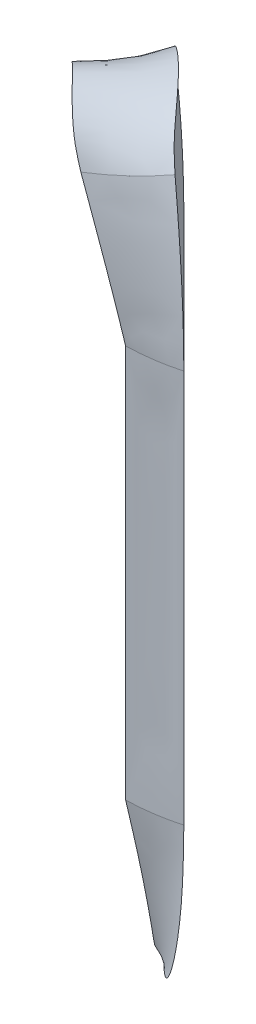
ISO-10303-21;
HEADER;
FILE_DESCRIPTION(('STEP AP214'),'2;1');
FILE_NAME('part.step','',(''),(''),'','','');
FILE_SCHEMA(('AUTOMOTIVE_DESIGN { 1 0 10303 214 1 1 1 1 }'));
ENDSEC;
DATA;
#1=APPLICATION_CONTEXT('core data for automotive mechanical design processes');
#2=APPLICATION_PROTOCOL_DEFINITION('international standard','automotive_design',2000,#1);
#3=PRODUCT_CONTEXT('',#1,'mechanical');
#4=PRODUCT('Part','Part','',(#3));
#5=PRODUCT_RELATED_PRODUCT_CATEGORY('part','',(#4));
#6=PRODUCT_DEFINITION_FORMATION('','',#4);
#7=PRODUCT_DEFINITION_CONTEXT('part definition',#1,'design');
#8=PRODUCT_DEFINITION('design','',#6,#7);
#9=PRODUCT_DEFINITION_SHAPE('','',#8);
#10=(LENGTH_UNIT() NAMED_UNIT(*) SI_UNIT(.MILLI.,.METRE.));
#11=(NAMED_UNIT(*) PLANE_ANGLE_UNIT() SI_UNIT($,.RADIAN.));
#12=(NAMED_UNIT(*) SI_UNIT($,.STERADIAN.) SOLID_ANGLE_UNIT());
#13=UNCERTAINTY_MEASURE_WITH_UNIT(LENGTH_MEASURE(1.E-05),#10,'distance_accuracy_value','');
#14=(GEOMETRIC_REPRESENTATION_CONTEXT(3) GLOBAL_UNCERTAINTY_ASSIGNED_CONTEXT((#13)) GLOBAL_UNIT_ASSIGNED_CONTEXT((#10,
#11,#12)) REPRESENTATION_CONTEXT('',''));
#15=CARTESIAN_POINT('',(0.,0.,0.));
#16=DIRECTION('',(0.,0.,1.));
#17=DIRECTION('',(1.,0.,0.));
#18=AXIS2_PLACEMENT_3D('',#15,#16,#17);
#19=CARTESIAN_POINT('',(-184.328448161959,512.262257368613,194.935049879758));
#20=DIRECTION('',(-0.707106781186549,0.,-0.707106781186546));
#21=DIRECTION('',(-0.35568881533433,0.864274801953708,0.355688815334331));
#22=AXIS2_PLACEMENT_3D('',#19,#20,#21);
#23=PLANE('',#22);
#24=CARTESIAN_POINT('',(-23.7892239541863,122.174067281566,34.3958256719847));
#25=CARTESIAN_POINT('',(-23.7892239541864,120.268907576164,34.3958256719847));
#26=CARTESIAN_POINT('',(-23.7892239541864,116.45858816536,34.3958256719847));
#27=CARTESIAN_POINT('',(-23.7892239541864,111.378162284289,34.3958256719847));
#28=CARTESIAN_POINT('',(-23.7892239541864,107.567842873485,34.3958256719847));
#29=CARTESIAN_POINT('',(-23.7892239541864,103.757523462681,34.3958256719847));
#30=CARTESIAN_POINT('',(-23.7892239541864,99.3121508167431,34.3958256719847));
#31=CARTESIAN_POINT('',(-23.7892239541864,94.8667781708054,34.3958256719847));
#32=CARTESIAN_POINT('',(-23.7892239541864,91.0564587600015,34.3958256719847));
#33=CARTESIAN_POINT('',(-23.7892239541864,87.2461393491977,34.3958256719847));
#34=CARTESIAN_POINT('',(-23.7892239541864,82.165713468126,34.3958256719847));
#35=CARTESIAN_POINT('',(-23.7892239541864,78.3553940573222,34.3958256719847));
#36=CARTESIAN_POINT('',(-23.7892239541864,76.4502343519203,34.3958256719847));
#37=(BOUNDED_CURVE() B_SPLINE_CURVE(3,(#24,#25,#26,#27,#28,#29,#30,#31,#32,#33,#34,#35,#36),
.UNSPECIFIED.,.F.,.F.) B_SPLINE_CURVE_WITH_KNOTS((4,1,1,1,1,1,1,1,1,1,4),(0.666666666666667,
0.6875,0.708333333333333,0.722222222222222,0.729166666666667,0.75,0.770833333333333,
0.777777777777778,0.791666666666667,0.8125,0.833333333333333),
.UNSPECIFIED.) CURVE() GEOMETRIC_REPRESENTATION_ITEM() RATIONAL_B_SPLINE_CURVE((1.,1.,1.,1.,1.,
1.,1.,1.,1.,1.,1.,1.,1.)) REPRESENTATION_ITEM(''));
#38=CARTESIAN_POINT('',(-23.7892239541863,122.174067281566,34.3958256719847));
#39=VERTEX_POINT('',#38);
#40=CARTESIAN_POINT('',(-23.7892239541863,76.4502343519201,34.3958256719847));
#41=VERTEX_POINT('',#40);
#42=EDGE_CURVE('E132',#39,#41,#37,.T.);
#43=ORIENTED_EDGE('',*,*,#42,.F.);
#44=DIRECTION('',(0.35568881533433,-0.864274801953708,-0.355688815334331));
#45=VECTOR('',#44,1.);
#46=CARTESIAN_POINT('',(-184.328448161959,512.262257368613,194.935049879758));
#47=LINE('',#46,#45);
#48=CARTESIAN_POINT('',(-21.0382063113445,115.489473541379,31.6448080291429));
#49=VERTEX_POINT('',#48);
#50=EDGE_CURVE('E477',#39,#49,#47,.T.);
#51=ORIENTED_EDGE('',*,*,#50,.T.);
#52=DIRECTION('',(0.,-1.,0.));
#53=VECTOR('',#52,1.);
#54=CARTESIAN_POINT('',(-21.0382063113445,115.489473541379,31.6448080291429));
#55=LINE('',#54,#53);
#56=CARTESIAN_POINT('',(-21.0382063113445,69.7656406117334,31.6448080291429));
#57=VERTEX_POINT('',#56);
#58=EDGE_CURVE('E434',#49,#57,#55,.T.);
#59=ORIENTED_EDGE('',*,*,#58,.T.);
#60=DIRECTION('',(-0.35568881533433,0.864274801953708,0.355688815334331));
#61=VECTOR('',#60,1.);
#62=CARTESIAN_POINT('',(-198.384543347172,500.692798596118,208.991145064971));
#63=LINE('',#62,#61);
#64=EDGE_CURVE('E474',#41,#57,#63,.F.);
#65=ORIENTED_EDGE('',*,*,#64,.F.);
#66=EDGE_LOOP('',(#43,#51,#59,#65));
#67=FACE_BOUND('',#66,.T.);
#68=ADVANCED_FACE('F66',(#67),#23,.T.);
#69=CARTESIAN_POINT('',(-189.631749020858,512.262257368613,189.631749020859));
#70=DIRECTION('',(0.35568881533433,-0.864274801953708,-0.355688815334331));
#71=DIRECTION('',(-0.707106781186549,0.,-0.707106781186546));
#72=AXIS2_PLACEMENT_3D('',#69,#70,#71);
#73=CYLINDRICAL_SURFACE('',#72,7.5);
#74=CARTESIAN_POINT('',(-35.6728053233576,138.370116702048,27.7212591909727));
#75=CARTESIAN_POINT('',(-35.6455750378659,139.063939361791,27.9723250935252));
#76=CARTESIAN_POINT('',(-35.5936347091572,140.38736937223,28.4512200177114));
#77=CARTESIAN_POINT('',(-35.0361985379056,142.36395853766,29.332145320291));
#78=CARTESIAN_POINT('',(-33.9426941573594,144.075180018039,30.4858604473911));
#79=CARTESIAN_POINT('',(-32.2713107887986,144.841762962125,32.0847811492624));
#80=CARTESIAN_POINT('',(-30.6614985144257,144.201799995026,33.7543538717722));
#81=CARTESIAN_POINT('',(-29.4831797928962,142.652799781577,34.9132619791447));
#82=CARTESIAN_POINT('',(-28.522711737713,140.604321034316,35.5777255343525));
#83=CARTESIAN_POINT('',(-27.995752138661,139.135316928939,35.6402269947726));
#84=CARTESIAN_POINT('',(-27.7210976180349,138.369663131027,35.6728031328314));
#85=(BOUNDED_CURVE() B_SPLINE_CURVE(3,(#74,#75,#76,#77,#78,#79,#80,#81,#82,#83,#84),
.UNSPECIFIED.,.F.,.F.) B_SPLINE_CURVE_WITH_KNOTS((4,1,1,1,1,1,1,1,4),(0.333333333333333,
0.353945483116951,0.372649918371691,0.393888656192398,0.416666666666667,0.436299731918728,
0.456899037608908,0.477535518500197,0.5),
.UNSPECIFIED.) CURVE() GEOMETRIC_REPRESENTATION_ITEM() RATIONAL_B_SPLINE_CURVE((1.,1.,1.,1.,1.,
1.,1.,1.,1.,1.,1.)) REPRESENTATION_ITEM(''));
#86=CARTESIAN_POINT('',(-35.6728047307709,138.370115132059,27.7212635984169));
#87=VERTEX_POINT('',#86);
#88=CARTESIAN_POINT('',(-27.7211018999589,138.369661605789,35.6728025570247));
#89=VERTEX_POINT('',#88);
#90=EDGE_CURVE('E228',#87,#89,#85,.T.);
#91=ORIENTED_EDGE('',*,*,#90,.F.);
#92=CARTESIAN_POINT('',(-34.3958256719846,122.174067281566,23.7892239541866));
#93=CARTESIAN_POINT('',(-34.4859672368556,122.852316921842,23.887496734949));
#94=CARTESIAN_POINT('',(-34.6663049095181,124.209226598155,24.084101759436));
#95=CARTESIAN_POINT('',(-34.8762829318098,126.025090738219,24.4102537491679));
#96=CARTESIAN_POINT('',(-35.0176524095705,127.369298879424,24.6785381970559));
#97=CARTESIAN_POINT('',(-35.151919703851,128.736643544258,24.9693568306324));
#98=CARTESIAN_POINT('',(-35.2887619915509,130.27347666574,25.3221092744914));
#99=CARTESIAN_POINT('',(-35.4093163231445,131.864566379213,25.7251510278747));
#100=CARTESIAN_POINT('',(-35.4940025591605,133.160578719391,26.0755576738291));
#101=CARTESIAN_POINT('',(-35.5688618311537,134.486124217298,26.4522242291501));
#102=CARTESIAN_POINT('',(-35.645950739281,136.255919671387,26.9898475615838));
#103=CARTESIAN_POINT('',(-35.6635944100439,137.644963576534,27.4703906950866));
#104=CARTESIAN_POINT('',(-35.6728053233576,138.370116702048,27.7212591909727));
#105=(BOUNDED_CURVE() B_SPLINE_CURVE(3,(#92,#93,#94,#95,#96,#97,#98,#99,#100,#101,#102,#103,
#104),.UNSPECIFIED.,.F.,.F.) B_SPLINE_CURVE_WITH_KNOTS((4,1,1,1,1,1,1,1,1,1,4),
(0.166666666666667,0.187297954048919,0.207941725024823,0.222222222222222,0.228558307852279,0.25,
0.26963577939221,0.277777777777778,0.290198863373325,0.310814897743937,0.333333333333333),
.UNSPECIFIED.) CURVE() GEOMETRIC_REPRESENTATION_ITEM() RATIONAL_B_SPLINE_CURVE((1.,1.,1.,1.,1.,
1.,1.,1.,1.,1.,1.,1.,1.)) REPRESENTATION_ITEM(''));
#106=CARTESIAN_POINT('',(-34.3958256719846,122.174067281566,23.7892239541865));
#107=VERTEX_POINT('',#106);
#108=EDGE_CURVE('E157',#107,#87,#105,.T.);
#109=ORIENTED_EDGE('',*,*,#108,.F.);
#110=DIRECTION('',(0.35568881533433,-0.864274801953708,-0.355688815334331));
#111=VECTOR('',#110,1.);
#112=CARTESIAN_POINT('',(-194.935049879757,512.262257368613,184.32844816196));
#113=LINE('',#112,#111);
#114=CARTESIAN_POINT('',(-31.6448080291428,115.489473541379,21.0382063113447));
#115=VERTEX_POINT('',#114);
#116=EDGE_CURVE('E145',#107,#115,#113,.T.);
#117=ORIENTED_EDGE('',*,*,#116,.T.);
#118=CARTESIAN_POINT('',(-29.3671957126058,129.415472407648,24.1157171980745));
#119=CARTESIAN_POINT('',(-29.251160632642,129.652337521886,24.257022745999));
#120=CARTESIAN_POINT('',(-29.1273042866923,129.881044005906,24.4057911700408));
#121=CARTESIAN_POINT('',(-28.8607456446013,130.315117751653,24.7204346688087));
#122=CARTESIAN_POINT('',(-28.7180404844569,130.520481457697,24.8863123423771));
#123=CARTESIAN_POINT('',(-28.436322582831,130.864784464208,25.2074030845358));
#124=CARTESIAN_POINT('',(-28.3006960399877,131.009088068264,25.3597476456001));
#125=CARTESIAN_POINT('',(-28.0130839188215,131.263515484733,25.6770840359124));
#126=CARTESIAN_POINT('',(-27.8611370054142,131.373717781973,25.8420457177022));
#127=CARTESIAN_POINT('',(-27.5804938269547,131.527332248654,26.1409198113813));
#128=CARTESIAN_POINT('',(-27.4549684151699,131.580426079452,26.2727833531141));
#129=CARTESIAN_POINT('',(-27.1975577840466,131.655414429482,26.5391601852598));
#130=CARTESIAN_POINT('',(-27.0656786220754,131.67733807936,26.6736708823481));
#131=CARTESIAN_POINT('',(-26.7989287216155,131.687699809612,26.9416634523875));
#132=CARTESIAN_POINT('',(-26.6640517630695,131.676060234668,27.0751422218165));
#133=CARTESIAN_POINT('',(-26.3957859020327,131.620424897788,27.3367464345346));
#134=CARTESIAN_POINT('',(-26.2623982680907,131.576403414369,27.4648675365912));
#135=CARTESIAN_POINT('',(-25.9685883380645,131.445985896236,27.7431570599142));
#136=CARTESIAN_POINT('',(-25.8095079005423,131.35187300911,27.891080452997));
#137=CARTESIAN_POINT('',(-25.502194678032,131.13015669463,28.1723584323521));
#138=CARTESIAN_POINT('',(-25.3539849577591,131.002484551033,28.3056823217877));
#139=CARTESIAN_POINT('',(-25.0975683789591,130.750494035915,28.5330562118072));
#140=CARTESIAN_POINT('',(-24.9872516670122,130.630517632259,28.6296553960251));
#141=CARTESIAN_POINT('',(-24.7738210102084,130.37827500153,28.8145405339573));
#142=CARTESIAN_POINT('',(-24.6707118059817,130.246000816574,28.902821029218));
#143=CARTESIAN_POINT('',(-24.4711419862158,129.971682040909,29.0719856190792));
#144=CARTESIAN_POINT('',(-24.3746933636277,129.829620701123,29.1528564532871));
#145=CARTESIAN_POINT('',(-24.1880674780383,129.537869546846,29.3078847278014));
#146=CARTESIAN_POINT('',(-24.097892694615,129.38817675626,29.3820395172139));
#147=CARTESIAN_POINT('',(-23.9239131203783,129.083712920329,29.5238699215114));
#148=CARTESIAN_POINT('',(-23.840070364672,128.928981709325,29.5915849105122));
#149=CARTESIAN_POINT('',(-23.6776388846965,128.614593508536,29.7217129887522));
#150=CARTESIAN_POINT('',(-23.5990512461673,128.454935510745,29.7841249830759));
#151=CARTESIAN_POINT('',(-23.3704596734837,127.969677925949,29.9643029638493));
#152=CARTESIAN_POINT('',(-23.2277285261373,127.637976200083,30.074928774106));
#153=CARTESIAN_POINT('',(-22.9588555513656,126.962497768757,30.2806795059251));
#154=CARTESIAN_POINT('',(-22.8327516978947,126.618695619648,30.3757690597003));
#155=CARTESIAN_POINT('',(-22.5956440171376,125.922714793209,30.5525565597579));
#156=CARTESIAN_POINT('',(-22.4846357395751,125.570538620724,30.6342584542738));
#157=CARTESIAN_POINT('',(-22.2762364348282,124.859408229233,30.786131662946));
#158=CARTESIAN_POINT('',(-22.1788580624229,124.500448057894,30.8562922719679));
#159=CARTESIAN_POINT('',(-21.996864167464,123.777414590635,30.9862947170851));
#160=CARTESIAN_POINT('',(-21.9122508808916,123.413340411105,31.0461347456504));
#161=CARTESIAN_POINT('',(-21.7550826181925,122.680888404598,31.1564695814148));
#162=CARTESIAN_POINT('',(-21.6825377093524,122.312507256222,31.2069565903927));
#163=CARTESIAN_POINT('',(-21.5491679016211,121.572576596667,31.2992001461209));
#164=CARTESIAN_POINT('',(-21.4883423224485,121.201027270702,31.3409571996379));
#165=CARTESIAN_POINT('',(-21.3780886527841,120.454860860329,31.416266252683));
#166=CARTESIAN_POINT('',(-21.328677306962,120.080240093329,31.4498062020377));
#167=CARTESIAN_POINT('',(-21.2412895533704,119.32903456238,31.5088939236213));
#168=CARTESIAN_POINT('',(-21.2033134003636,118.952449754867,31.5344415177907));
#169=CARTESIAN_POINT('',(-21.1388819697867,118.198042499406,31.5776689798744));
#170=CARTESIAN_POINT('',(-21.1124206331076,117.820220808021,31.5953529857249));
#171=CARTESIAN_POINT('',(-21.0711961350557,117.06367862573,31.6228601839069));
#172=CARTESIAN_POINT('',(-21.0564325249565,116.684958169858,31.6326836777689));
#173=CARTESIAN_POINT('',(-21.0334541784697,115.690547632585,31.6479735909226));
#174=CARTESIAN_POINT('',(-21.0350780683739,115.074486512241,31.6468938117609));
#175=CARTESIAN_POINT('',(-21.0721673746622,113.843562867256,31.6222130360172));
#176=CARTESIAN_POINT('',(-21.107641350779,113.2287006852,31.5986063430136));
#177=CARTESIAN_POINT('',(-21.1885265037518,112.311148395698,31.5443700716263));
#178=CARTESIAN_POINT('',(-21.2200210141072,112.006619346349,31.5232072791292));
#179=CARTESIAN_POINT('',(-21.2927128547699,111.399277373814,31.474153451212));
#180=CARTESIAN_POINT('',(-21.3339091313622,111.096464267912,31.4462631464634));
#181=CARTESIAN_POINT('',(-21.4265510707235,110.493339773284,31.383212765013));
#182=CARTESIAN_POINT('',(-21.4779908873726,110.193027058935,31.3480568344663));
#183=CARTESIAN_POINT('',(-21.5917876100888,109.595555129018,31.2697855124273));
#184=CARTESIAN_POINT('',(-21.6541427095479,109.298395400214,31.2266714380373));
#185=CARTESIAN_POINT('',(-21.7880454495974,108.718913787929,31.1333822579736));
#186=CARTESIAN_POINT('',(-21.8591757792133,108.436445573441,31.0835213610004));
#187=CARTESIAN_POINT('',(-22.0130362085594,107.876435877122,30.9747497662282));
#188=CARTESIAN_POINT('',(-22.0957658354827,107.598894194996,30.9158394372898));
#189=CARTESIAN_POINT('',(-22.2737198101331,107.050014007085,30.7878779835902));
#190=CARTESIAN_POINT('',(-22.368951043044,106.778679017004,30.718821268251));
#191=CARTESIAN_POINT('',(-22.572785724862,106.244262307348,30.5693529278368));
#192=CARTESIAN_POINT('',(-22.6813871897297,105.981179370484,30.4889429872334));
#193=CARTESIAN_POINT('',(-22.8935225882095,105.508916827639,30.3298715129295));
#194=CARTESIAN_POINT('',(-22.9948567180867,105.298091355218,30.2531744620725));
#195=CARTESIAN_POINT('',(-23.2080206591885,104.885662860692,30.0899620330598));
#196=CARTESIAN_POINT('',(-23.319851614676,104.684060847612,30.0034455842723));
#197=CARTESIAN_POINT('',(-23.554282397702,104.292770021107,29.8197569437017));
#198=CARTESIAN_POINT('',(-23.6768624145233,104.103060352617,29.722604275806));
#199=CARTESIAN_POINT('',(-23.9331612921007,103.738223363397,29.516619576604));
#200=CARTESIAN_POINT('',(-24.0668741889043,103.563088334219,29.4077937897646));
#201=CARTESIAN_POINT('',(-24.3874845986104,103.180946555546,29.1428510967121));
#202=CARTESIAN_POINT('',(-24.578318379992,102.980099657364,28.9823311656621));
#203=CARTESIAN_POINT('',(-24.8775351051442,102.709340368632,28.7249984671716));
#204=CARTESIAN_POINT('',(-24.9794285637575,102.624176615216,28.6364678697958));
#205=CARTESIAN_POINT('',(-25.1871584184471,102.465358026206,28.4539301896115));
#206=CARTESIAN_POINT('',(-25.2929924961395,102.391696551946,28.359926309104));
#207=CARTESIAN_POINT('',(-25.4915481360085,102.267576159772,28.1814826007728));
#208=CARTESIAN_POINT('',(-25.5837956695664,102.215291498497,28.097782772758));
#209=CARTESIAN_POINT('',(-25.7701841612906,102.120822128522,27.926932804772));
#210=CARTESIAN_POINT('',(-25.8643242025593,102.078632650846,27.8397843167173));
#211=CARTESIAN_POINT('',(-26.053916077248,102.005089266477,27.6624347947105));
#212=CARTESIAN_POINT('',(-26.1493675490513,101.973732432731,27.5722345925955));
#213=CARTESIAN_POINT('',(-26.3409206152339,101.922449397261,27.3892942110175));
#214=CARTESIAN_POINT('',(-26.43702221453,101.902523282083,27.2965540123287));
#215=CARTESIAN_POINT('',(-26.6294659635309,101.874467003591,27.1088485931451));
#216=CARTESIAN_POINT('',(-26.7258077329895,101.866379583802,27.0138765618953));
#217=CARTESIAN_POINT('',(-26.9175969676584,101.862312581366,26.8227757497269));
#218=CARTESIAN_POINT('',(-27.0130444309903,101.866333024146,26.7266469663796));
#219=CARTESIAN_POINT('',(-27.2022924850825,101.886395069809,26.5340068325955));
#220=CARTESIAN_POINT('',(-27.2960928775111,101.902438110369,26.4374954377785));
#221=CARTESIAN_POINT('',(-27.4813427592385,101.946205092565,26.2448787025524));
#222=CARTESIAN_POINT('',(-27.5727922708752,101.973928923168,26.1487733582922));
#223=CARTESIAN_POINT('',(-27.7479557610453,102.038723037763,25.9627885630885));
#224=CARTESIAN_POINT('',(-27.8318221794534,102.075215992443,25.8728504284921));
#225=CARTESIAN_POINT('',(-27.9965586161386,102.15756401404,25.6945025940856));
#226=CARTESIAN_POINT('',(-28.0774276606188,102.203422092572,25.6060933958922));
#227=CARTESIAN_POINT('',(-28.3150353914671,102.353992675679,25.3439204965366));
#228=CARTESIAN_POINT('',(-28.4668686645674,102.471737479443,25.1731113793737));
#229=CARTESIAN_POINT('',(-28.8247598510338,102.798770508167,24.7636518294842));
#230=CARTESIAN_POINT('',(-29.0224252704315,103.024999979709,24.5312021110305));
#231=CARTESIAN_POINT('',(-29.2959786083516,103.398108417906,24.2026042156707));
#232=CARTESIAN_POINT('',(-29.3834599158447,103.528339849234,24.0962643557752));
#233=CARTESIAN_POINT('',(-29.5511854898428,103.798407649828,23.890270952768));
#234=CARTESIAN_POINT('',(-29.6314310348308,103.938242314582,23.790616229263));
#235=CARTESIAN_POINT('',(-29.8263991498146,104.303303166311,23.5461652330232));
#236=CARTESIAN_POINT('',(-29.9364758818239,104.534035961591,23.4058888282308));
#237=CARTESIAN_POINT('',(-30.1422030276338,105.010129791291,23.1403499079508));
#238=CARTESIAN_POINT('',(-30.237845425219,105.255498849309,23.0150957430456));
#239=CARTESIAN_POINT('',(-30.4163684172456,105.757738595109,22.7786411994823));
#240=CARTESIAN_POINT('',(-30.4992328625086,106.014623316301,22.667458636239));
#241=CARTESIAN_POINT('',(-30.6535268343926,106.537138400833,22.458365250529));
#242=CARTESIAN_POINT('',(-30.7249522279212,106.802771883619,22.3604592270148));
#243=CARTESIAN_POINT('',(-30.848522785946,107.303980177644,22.1895959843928));
#244=CARTESIAN_POINT('',(-30.9019688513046,107.53870224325,22.1150577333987));
#245=CARTESIAN_POINT('',(-31.0019454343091,108.012202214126,21.9746847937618));
#246=CARTESIAN_POINT('',(-31.0484748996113,108.250980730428,21.9088514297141));
#247=CARTESIAN_POINT('',(-31.1786539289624,108.972403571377,21.7235951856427));
#248=CARTESIAN_POINT('',(-31.2528525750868,109.459961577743,21.6164741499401));
#249=CARTESIAN_POINT('',(-31.380019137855,110.444140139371,21.4314454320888));
#250=CARTESIAN_POINT('',(-31.4329436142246,110.940777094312,21.3535975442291));
#251=CARTESIAN_POINT('',(-31.5201858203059,111.938994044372,21.2246069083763));
#252=CARTESIAN_POINT('',(-31.5545067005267,112.440573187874,21.173459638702));
#253=CARTESIAN_POINT('',(-31.6016182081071,113.350723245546,21.1030586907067));
#254=CARTESIAN_POINT('',(-31.617262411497,113.758837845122,21.0795889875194));
#255=CARTESIAN_POINT('',(-31.6384418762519,114.575960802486,21.0477878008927));
#256=CARTESIAN_POINT('',(-31.6439759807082,114.984969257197,21.0394580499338));
#257=CARTESIAN_POINT('',(-31.6454667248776,115.803313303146,21.0372153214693));
#258=CARTESIAN_POINT('',(-31.6414167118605,116.21264892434,21.0433123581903));
#259=CARTESIAN_POINT('',(-31.6240506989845,117.030658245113,21.0694010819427));
#260=CARTESIAN_POINT('',(-31.6107350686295,117.439331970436,21.0893922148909));
#261=CARTESIAN_POINT('',(-31.5749379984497,118.256105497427,21.1429498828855));
#262=CARTESIAN_POINT('',(-31.5524405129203,118.664203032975,21.1765401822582));
#263=CARTESIAN_POINT('',(-31.4982169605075,119.478475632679,21.2571091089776));
#264=CARTESIAN_POINT('',(-31.4664905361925,119.884650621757,21.3040882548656));
#265=CARTESIAN_POINT('',(-31.3935722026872,120.694094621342,21.4113950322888));
#266=CARTESIAN_POINT('',(-31.3523869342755,121.09736546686,21.4717132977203));
#267=CARTESIAN_POINT('',(-31.26005377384,121.900457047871,21.6059174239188));
#268=CARTESIAN_POINT('',(-31.2089069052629,122.300278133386,21.6798018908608));
#269=CARTESIAN_POINT('',(-31.083221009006,123.184793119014,21.8597354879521));
#270=CARTESIAN_POINT('',(-31.0060083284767,123.668405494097,21.9692819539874));
#271=CARTESIAN_POINT('',(-30.8334172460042,124.62702752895,22.2108656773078));
#272=CARTESIAN_POINT('',(-30.7380318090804,125.102033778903,22.3429116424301));
#273=CARTESIAN_POINT('',(-30.5792575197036,125.803822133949,22.5591855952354));
#274=CARTESIAN_POINT('',(-30.5238937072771,126.035330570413,22.6340758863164));
#275=CARTESIAN_POINT('',(-30.4073405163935,126.49462391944,22.790418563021));
#276=CARTESIAN_POINT('',(-30.346151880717,126.722409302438,22.8718701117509));
#277=CARTESIAN_POINT('',(-30.2173542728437,127.173260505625,23.0417631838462));
#278=CARTESIAN_POINT('',(-30.1497514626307,127.396330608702,23.1301979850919));
#279=CARTESIAN_POINT('',(-30.0072767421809,127.836874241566,23.3147366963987));
#280=CARTESIAN_POINT('',(-29.9324069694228,128.054349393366,23.4108383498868));
#281=CARTESIAN_POINT('',(-29.8167933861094,128.367421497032,23.5576381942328));
#282=CARTESIAN_POINT('',(-29.7793005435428,128.465786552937,23.6050221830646));
#283=CARTESIAN_POINT('',(-29.7024159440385,128.660817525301,23.7016940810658));
#284=CARTESIAN_POINT('',(-29.6630242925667,128.757483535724,23.750981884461));
#285=CARTESIAN_POINT('',(-29.5417448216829,129.044774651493,23.9019247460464));
#286=CARTESIAN_POINT('',(-29.4568023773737,129.232556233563,24.0065957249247));
#287=CARTESIAN_POINT('',(-29.3671957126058,129.415472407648,24.1157171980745));
#288=B_SPLINE_CURVE_WITH_KNOTS('',3,(#118,#119,#120,#121,#122,#123,#124,#125,#126,#127,#128,
#129,#130,#131,#132,#133,#134,#135,#136,#137,#138,#139,#140,#141,#142,#143,#144,#145,#146,#147,
#148,#149,#150,#151,#152,#153,#154,#155,#156,#157,#158,#159,#160,#161,#162,#163,#164,#165,#166,
#167,#168,#169,#170,#171,#172,#173,#174,#175,#176,#177,#178,#179,#180,#181,#182,#183,#184,#185,
#186,#187,#188,#189,#190,#191,#192,#193,#194,#195,#196,#197,#198,#199,#200,#201,#202,#203,#204,
#205,#206,#207,#208,#209,#210,#211,#212,#213,#214,#215,#216,#217,#218,#219,#220,#221,#222,#223,
#224,#225,#226,#227,#228,#229,#230,#231,#232,#233,#234,#235,#236,#237,#238,#239,#240,#241,#242,
#243,#244,#245,#246,#247,#248,#249,#250,#251,#252,#253,#254,#255,#256,#257,#258,#259,#260,#261,
#262,#263,#264,#265,#266,#267,#268,#269,#270,#271,#272,#273,#274,#275,#276,#277,#278,#279,#280,
#281,#282,#283,#284,#285,#286,#287),.UNSPECIFIED.,.T.,.F.,(4,2,2,2,2,2,2,2,2,2,2,2,2,2,2,2,2,2,
2,2,2,2,2,2,2,2,2,2,2,2,2,2,2,2,2,2,2,2,2,2,2,2,2,2,2,2,2,2,2,2,2,2,2,2,2,2,2,2,2,2,2,2,2,2,2,2,
2,2,2,2,2,2,2,2,2,2,2,2,2,2,2,2,2,2,4),(0.,0.897403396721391,1.79494330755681,2.54212682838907,
3.28757767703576,3.85413732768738,4.42016714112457,4.98750762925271,5.55529925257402,
6.26158651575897,6.96933140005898,7.53693146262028,8.10490140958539,8.67386871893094,
9.24305963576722,9.8085102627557,10.3740773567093,11.505879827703,12.6402239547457,
13.7742329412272,14.909287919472,16.0445414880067,17.1807373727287,18.3168672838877,
19.4546534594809,20.5924649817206,21.7296770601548,22.8668455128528,24.7137679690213,
26.5611575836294,27.4816197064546,28.4019819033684,29.3218203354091,30.2415066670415,
31.1277107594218,32.0138787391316,32.9005368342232,33.7870635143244,34.5250498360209,
35.2631166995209,35.9998507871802,36.7361927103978,37.693026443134,38.1713862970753,
38.6494690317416,39.0543363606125,39.459012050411,39.8635783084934,40.2681476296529,
40.674174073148,41.0802013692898,41.4862772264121,41.8923492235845,42.2767642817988,
42.661303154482,43.4299595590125,44.5628020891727,45.1310370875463,45.6991714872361,
46.5726100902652,47.4465319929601,48.3215494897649,49.1968824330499,49.9526005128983,
50.7084334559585,52.2206604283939,53.7359597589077,55.2510023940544,56.4778632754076,
57.7048645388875,58.9327177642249,60.1605220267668,61.3904811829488,62.6204879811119,
63.8496338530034,65.0786535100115,66.583385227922,68.088700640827,68.8371732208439,
69.5855504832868,70.333215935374,71.0806621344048,71.4269480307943,71.7732147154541,
72.4662234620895),.UNSPECIFIED.);
#289=EDGE_CURVE('E165',#115,#49,#288,.T.);
#290=ORIENTED_EDGE('',*,*,#289,.T.);
#291=ORIENTED_EDGE('',*,*,#50,.F.);
#292=CARTESIAN_POINT('',(-27.7210976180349,138.369663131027,35.6728031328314));
#293=CARTESIAN_POINT('',(-27.4875662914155,137.696149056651,35.6646528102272));
#294=CARTESIAN_POINT('',(-27.0465490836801,136.424237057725,35.6492611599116));
#295=CARTESIAN_POINT('',(-26.4530154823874,134.49744023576,35.5712030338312));
#296=CARTESIAN_POINT('',(-25.8837162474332,132.487053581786,35.4561003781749));
#297=CARTESIAN_POINT('',(-25.35098667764,130.396020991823,35.2992334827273));
#298=CARTESIAN_POINT('',(-24.8706806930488,128.309036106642,35.1141234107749));
#299=CARTESIAN_POINT('',(-24.4552712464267,126.274616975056,34.9050202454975));
#300=CARTESIAN_POINT('',(-24.0874846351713,124.231088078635,34.669106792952));
#301=CARTESIAN_POINT('',(-23.8886441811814,122.859740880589,34.4869193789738));
#302=CARTESIAN_POINT('',(-23.7892239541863,122.174067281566,34.3958256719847));
#303=(BOUNDED_CURVE() B_SPLINE_CURVE(3,(#292,#293,#294,#295,#296,#297,#298,#299,#300,#301,#302),
.UNSPECIFIED.,.F.,.F.) B_SPLINE_CURVE_WITH_KNOTS((4,1,1,1,1,1,1,1,4),(0.5,0.520833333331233,
0.539343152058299,0.560577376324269,0.583333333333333,0.604166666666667,0.625,0.645833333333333,
0.666666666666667),
.UNSPECIFIED.) CURVE() GEOMETRIC_REPRESENTATION_ITEM() RATIONAL_B_SPLINE_CURVE((1.,1.,1.,1.,1.,
1.,1.,1.,1.,1.,1.)) REPRESENTATION_ITEM(''));
#304=EDGE_CURVE('E388',#89,#39,#303,.T.);
#305=ORIENTED_EDGE('',*,*,#304,.F.);
#306=EDGE_LOOP('',(#91,#109,#117,#290,#291,#305));
#307=FACE_BOUND('',#306,.T.);
#308=ADVANCED_FACE('F501',(#307),#73,.F.);
#309=CARTESIAN_POINT('',(-194.935049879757,512.262257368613,184.32844816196));
#310=DIRECTION('',(0.707106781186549,0.,0.707106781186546));
#311=DIRECTION('',(0.35568881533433,-0.864274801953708,-0.355688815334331));
#312=AXIS2_PLACEMENT_3D('',#309,#310,#311);
#313=PLANE('',#312);
#314=DIRECTION('',(0.35568881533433,-0.864274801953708,-0.355688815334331));
#315=VECTOR('',#314,1.);
#316=CARTESIAN_POINT('',(-208.99114506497,500.692798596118,198.384543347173));
#317=LINE('',#316,#315);
#318=CARTESIAN_POINT('',(-34.3958256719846,76.4502343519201,23.7892239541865));
#319=VERTEX_POINT('',#318);
#320=CARTESIAN_POINT('',(-31.6448080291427,69.7656406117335,21.0382063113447));
#321=VERTEX_POINT('',#320);
#322=EDGE_CURVE('E137',#319,#321,#317,.T.);
#323=ORIENTED_EDGE('',*,*,#322,.T.);
#324=DIRECTION('',(0.,-1.,0.));
#325=VECTOR('',#324,1.);
#326=CARTESIAN_POINT('',(-31.6448080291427,69.7656406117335,21.0382063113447));
#327=LINE('',#326,#325);
#328=EDGE_CURVE('E404',#321,#115,#327,.F.);
#329=ORIENTED_EDGE('',*,*,#328,.T.);
#330=ORIENTED_EDGE('',*,*,#116,.F.);
#331=CARTESIAN_POINT('',(-34.3958256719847,76.4502343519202,23.7892239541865));
#332=CARTESIAN_POINT('',(-34.3958256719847,78.1820946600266,23.7892239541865));
#333=CARTESIAN_POINT('',(-34.3958256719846,81.6884534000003,23.7892239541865));
#334=CARTESIAN_POINT('',(-34.3958256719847,86.4513526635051,23.7892239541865));
#335=CARTESIAN_POINT('',(-34.3958256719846,90.097008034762,23.7892239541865));
#336=CARTESIAN_POINT('',(-34.3958256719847,93.258708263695,23.7892239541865));
#337=CARTESIAN_POINT('',(-34.3958256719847,96.1164478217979,23.7892239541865));
#338=CARTESIAN_POINT('',(-34.3958256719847,99.3121508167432,23.7892239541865));
#339=CARTESIAN_POINT('',(-34.3958256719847,102.169890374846,23.7892239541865));
#340=CARTESIAN_POINT('',(-34.3962078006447,104.710441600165,23.789647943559));
#341=CARTESIAN_POINT('',(-34.3958256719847,107.567842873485,23.7892239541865));
#342=CARTESIAN_POINT('',(-34.3958256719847,111.378162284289,23.7892239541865));
#343=CARTESIAN_POINT('',(-34.3958256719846,116.45858816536,23.7892239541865));
#344=CARTESIAN_POINT('',(-34.3958256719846,120.268907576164,23.7892239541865));
#345=CARTESIAN_POINT('',(-34.3958256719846,122.174067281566,23.7892239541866));
#346=(BOUNDED_CURVE() B_SPLINE_CURVE(3,(#331,#332,#333,#334,#335,#336,#337,#338,#339,#340,#341,
#342,#343,#344,#345),.UNSPECIFIED.,.F.,.F.) B_SPLINE_CURVE_WITH_KNOTS((4,1,1,1,1,1,1,1,1,1,1,1,
4),(0.,0.0189382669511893,0.0383427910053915,0.0520833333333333,0.0588042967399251,
0.0729166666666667,0.0833333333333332,0.09375,0.104166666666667,0.111111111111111,0.125,
0.145833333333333,0.166666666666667),
.UNSPECIFIED.) CURVE() GEOMETRIC_REPRESENTATION_ITEM() RATIONAL_B_SPLINE_CURVE((1.,1.,1.,1.,1.,
1.,1.,1.,1.,1.,1.,1.,1.,1.,1.)) REPRESENTATION_ITEM(''));
#347=EDGE_CURVE('E148',#319,#107,#346,.T.);
#348=ORIENTED_EDGE('',*,*,#347,.F.);
#349=EDGE_LOOP('',(#323,#329,#330,#348));
#350=FACE_BOUND('',#349,.T.);
#351=ADVANCED_FACE('F150',(#350),#313,.T.);
#352=CARTESIAN_POINT('',(-203.687844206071,500.692798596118,203.687844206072));
#353=DIRECTION('',(0.35568881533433,-0.864274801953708,-0.355688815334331));
#354=DIRECTION('',(-0.707106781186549,0.,-0.707106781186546));
#355=AXIS2_PLACEMENT_3D('',#352,#353,#354);
#356=CYLINDRICAL_SURFACE('',#355,7.5);
#357=ORIENTED_EDGE('',*,*,#64,.T.);
#358=CARTESIAN_POINT('',(-21.0382063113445,69.7656406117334,31.6448080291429));
#359=CARTESIAN_POINT('',(-21.0382185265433,69.4505450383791,31.644793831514));
#360=CARTESIAN_POINT('',(-21.0424751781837,69.1354326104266,31.6419696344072));
#361=CARTESIAN_POINT('',(-21.0598479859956,68.5054968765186,31.6304128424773));
#362=CARTESIAN_POINT('',(-21.0729660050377,68.1906736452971,31.6216790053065));
#363=CARTESIAN_POINT('',(-21.1085086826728,67.5604208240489,31.59796345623));
#364=CARTESIAN_POINT('',(-21.1309730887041,67.244994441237,31.5829550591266));
#365=CARTESIAN_POINT('',(-21.1856767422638,66.6153902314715,31.5462865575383));
#366=CARTESIAN_POINT('',(-21.2179153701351,66.3012123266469,31.5246268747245));
#367=CARTESIAN_POINT('',(-21.2930781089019,65.6715744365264,31.4739082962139));
#368=CARTESIAN_POINT('',(-21.3361040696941,65.3561321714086,31.4447788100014));
#369=CARTESIAN_POINT('',(-21.4333272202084,64.7278154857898,31.3785906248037));
#370=CARTESIAN_POINT('',(-21.4875236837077,64.4149408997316,31.3415324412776));
#371=CARTESIAN_POINT('',(-21.6077383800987,63.7931767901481,31.2587741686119));
#372=CARTESIAN_POINT('',(-21.6737360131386,63.4842813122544,31.2130891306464));
#373=CARTESIAN_POINT('',(-21.8184593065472,62.8711264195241,31.1120979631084));
#374=CARTESIAN_POINT('',(-21.8971815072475,62.5668657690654,31.056794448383));
#375=CARTESIAN_POINT('',(-22.0471591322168,62.0389355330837,30.9504278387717));
#376=CARTESIAN_POINT('',(-22.1154438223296,61.8139498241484,30.9017003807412));
#377=CARTESIAN_POINT('',(-22.2602417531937,61.3681879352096,30.7975583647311));
#378=CARTESIAN_POINT('',(-22.3367551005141,61.1474118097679,30.7421437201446));
#379=CARTESIAN_POINT('',(-22.4984668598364,60.7111410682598,30.6239941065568));
#380=CARTESIAN_POINT('',(-22.5836619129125,60.4956444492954,30.5612619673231));
#381=CARTESIAN_POINT('',(-22.7632730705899,60.0710670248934,30.4277164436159));
#382=CARTESIAN_POINT('',(-22.8576890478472,59.8619861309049,30.3569031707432));
#383=CARTESIAN_POINT('',(-23.057325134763,59.4495656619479,30.2055561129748));
#384=CARTESIAN_POINT('',(-23.1626501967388,59.2463116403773,30.124926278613));
#385=CARTESIAN_POINT('',(-23.3837634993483,58.8498745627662,29.953617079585));
#386=CARTESIAN_POINT('',(-23.4995535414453,58.6566932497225,29.8629359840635));
#387=CARTESIAN_POINT('',(-23.7417253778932,58.283354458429,29.670765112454));
#388=CARTESIAN_POINT('',(-23.8680830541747,58.1031689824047,29.5692998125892));
#389=CARTESIAN_POINT('',(-24.1317129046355,57.7585535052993,29.3545458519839));
#390=CARTESIAN_POINT('',(-24.2689829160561,57.5941203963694,29.2412595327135));
#391=CARTESIAN_POINT('',(-24.5909610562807,57.2450801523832,28.9713515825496));
#392=CARTESIAN_POINT('',(-24.7788264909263,57.0660587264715,28.8110544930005));
#393=CARTESIAN_POINT('',(-25.0717816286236,56.8275976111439,28.5556049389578));
#394=CARTESIAN_POINT('',(-25.1713201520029,56.7531069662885,28.4679297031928));
#395=CARTESIAN_POINT('',(-25.3736809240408,56.6153493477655,28.2877120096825));
#396=CARTESIAN_POINT('',(-25.4765017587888,56.552077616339,28.1951716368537));
#397=CARTESIAN_POINT('',(-25.685928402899,56.4373535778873,28.0045235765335));
#398=CARTESIAN_POINT('',(-25.7925627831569,56.3860336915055,27.9063672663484));
#399=CARTESIAN_POINT('',(-26.0077415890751,56.2972322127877,27.7059377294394));
#400=CARTESIAN_POINT('',(-26.1162860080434,56.2597505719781,27.6036645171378));
#401=CARTESIAN_POINT('',(-26.334183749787,56.1995926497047,27.3958647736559));
#402=CARTESIAN_POINT('',(-26.4435362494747,56.1769029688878,27.2903412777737));
#403=CARTESIAN_POINT('',(-26.662026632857,56.1468905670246,27.0769208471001));
#404=CARTESIAN_POINT('',(-26.7711645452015,56.1395656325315,26.9690242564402));
#405=CARTESIAN_POINT('',(-26.9734924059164,56.1404134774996,26.7665530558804));
#406=CARTESIAN_POINT('',(-27.0668544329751,56.1466357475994,26.672136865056));
#407=CARTESIAN_POINT('',(-27.2518896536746,56.1706037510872,26.4830514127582));
#408=CARTESIAN_POINT('',(-27.3435622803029,56.1883532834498,26.3883820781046));
#409=CARTESIAN_POINT('',(-27.5245275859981,56.2350200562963,26.1995701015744));
#410=CARTESIAN_POINT('',(-27.6138207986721,56.2639347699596,26.1054273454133));
#411=CARTESIAN_POINT('',(-27.7895354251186,56.3323705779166,25.9182991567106));
#412=CARTESIAN_POINT('',(-27.8759556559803,56.3718959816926,25.8253142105));
#413=CARTESIAN_POINT('',(-28.1274691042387,56.5039401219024,25.5520241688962));
#414=CARTESIAN_POINT('',(-28.2878944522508,56.6107611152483,25.3741607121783));
#415=CARTESIAN_POINT('',(-28.5939573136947,56.8566338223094,25.0287651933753));
#416=CARTESIAN_POINT('',(-28.7395897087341,56.9956966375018,24.8612367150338));
#417=CARTESIAN_POINT('',(-29.0972556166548,57.3896219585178,24.4430741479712));
#418=CARTESIAN_POINT('',(-29.297994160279,57.6645003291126,24.2014821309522));
#419=CARTESIAN_POINT('',(-29.5727597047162,58.1106523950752,23.8636333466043));
#420=CARTESIAN_POINT('',(-29.6600735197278,58.2652769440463,23.7549564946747));
#421=CARTESIAN_POINT('',(-29.8265718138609,58.5840210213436,23.545561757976));
#422=CARTESIAN_POINT('',(-29.9057578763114,58.7481386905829,23.4448423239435));
#423=CARTESIAN_POINT('',(-30.1008166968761,59.1827300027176,23.1943716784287));
#424=CARTESIAN_POINT('',(-30.2109804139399,59.4591474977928,23.050493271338));
#425=CARTESIAN_POINT('',(-30.4147296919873,60.0266338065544,22.7809727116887));
#426=CARTESIAN_POINT('',(-30.5083048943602,60.317711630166,22.6553419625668));
#427=CARTESIAN_POINT('',(-30.681385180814,60.912365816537,22.420392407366));
#428=CARTESIAN_POINT('',(-30.7608094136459,61.2160025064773,22.3111678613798));
#429=CARTESIAN_POINT('',(-30.9067403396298,61.8314176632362,22.1085722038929));
#430=CARTESIAN_POINT('',(-30.9732496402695,62.1431944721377,22.0151978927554));
#431=CARTESIAN_POINT('',(-31.0913914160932,62.7548576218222,21.8480027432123));
#432=CARTESIAN_POINT('',(-31.1436578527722,63.0544019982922,21.7733682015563));
#433=CARTESIAN_POINT('',(-31.2391205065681,63.6577142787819,21.6361810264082));
#434=CARTESIAN_POINT('',(-31.2823149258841,63.9614830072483,21.5736307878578));
#435=CARTESIAN_POINT('',(-31.3605420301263,64.5725976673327,21.4597570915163));
#436=CARTESIAN_POINT('',(-31.3955629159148,64.8799481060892,21.4084498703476));
#437=CARTESIAN_POINT('',(-31.458080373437,65.4970011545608,21.3164787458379));
#438=CARTESIAN_POINT('',(-31.4855765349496,65.8067038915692,21.2758154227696));
#439=CARTESIAN_POINT('',(-31.533014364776,66.4198761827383,21.2054416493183));
#440=CARTESIAN_POINT('',(-31.5531306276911,66.7233035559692,21.1754785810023));
#441=CARTESIAN_POINT('',(-31.5872079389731,67.3312694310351,21.1246117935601));
#442=CARTESIAN_POINT('',(-31.6011686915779,67.6358079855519,21.1037085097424));
#443=CARTESIAN_POINT('',(-31.6232473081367,68.244433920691,21.0706109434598));
#444=CARTESIAN_POINT('',(-31.6313865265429,68.5485188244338,21.0583848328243));
#445=CARTESIAN_POINT('',(-31.6421602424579,69.1569542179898,21.0421885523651));
#446=CARTESIAN_POINT('',(-31.6447957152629,69.4613046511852,21.0382169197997));
#447=CARTESIAN_POINT('',(-31.6448080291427,69.7656406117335,21.0382063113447));
#448=B_SPLINE_CURVE_WITH_KNOTS('',3,(#358,#359,#360,#361,#362,#363,#364,#365,#366,#367,#368,
#369,#370,#371,#372,#373,#374,#375,#376,#377,#378,#379,#380,#381,#382,#383,#384,#385,#386,#387,
#388,#389,#390,#391,#392,#393,#394,#395,#396,#397,#398,#399,#400,#401,#402,#403,#404,#405,#406,
#407,#408,#409,#410,#411,#412,#413,#414,#415,#416,#417,#418,#419,#420,#421,#422,#423,#424,#425,
#426,#427,#428,#429,#430,#431,#432,#433,#434,#435,#436,#437,#438,#439,#440,#441,#442,#443,#444,
#445,#446,#447),.UNSPECIFIED.,.F.,.F.,(4,2,2,2,2,2,2,2,2,2,2,2,2,2,2,2,2,2,2,2,2,2,2,2,2,2,2,2,
2,2,2,2,2,2,2,2,2,2,2,2,2,2,2,2,4),(0.,0.945270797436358,1.89074037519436,2.84027253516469,
3.78974451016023,4.74854287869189,5.70727893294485,6.66435749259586,7.62117626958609,
8.34128769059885,9.0614084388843,9.78125162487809,10.5010848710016,11.2286332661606,
11.9563071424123,12.6823633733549,13.4082760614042,14.3197269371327,14.7756893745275,
15.2314579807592,15.692058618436,16.1526576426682,16.6128388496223,17.0729537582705,
17.4712316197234,17.8696408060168,18.2679598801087,18.6664409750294,19.4499559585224,
20.2337411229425,21.4782970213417,22.1025280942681,22.7266373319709,23.7166443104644,
24.7072673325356,25.7033804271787,26.6992921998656,27.6381535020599,28.5772006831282,
29.5175951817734,30.4580409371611,31.374530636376,32.2910643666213,33.2042185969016,
34.1172109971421),.UNSPECIFIED.);
#449=EDGE_CURVE('E141',#57,#321,#448,.T.);
#450=ORIENTED_EDGE('',*,*,#449,.T.);
#451=ORIENTED_EDGE('',*,*,#322,.F.);
#452=CARTESIAN_POINT('',(-23.7892239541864,76.4502343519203,34.3958256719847));
#453=CARTESIAN_POINT('',(-23.5954240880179,74.7909008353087,34.1525781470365));
#454=CARTESIAN_POINT('',(-23.2032073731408,71.432702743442,33.6602881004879));
#455=CARTESIAN_POINT('',(-23.1757554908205,66.8609160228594,32.7302929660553));
#456=CARTESIAN_POINT('',(-23.5533470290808,63.4449840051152,31.7905805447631));
#457=CARTESIAN_POINT('',(-24.2398329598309,60.6173598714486,30.7315278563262));
#458=CARTESIAN_POINT('',(-25.2346762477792,58.2371335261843,29.5167688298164));
#459=CARTESIAN_POINT('',(-27.3754375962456,56.8968475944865,27.3014592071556));
#460=CARTESIAN_POINT('',(-29.3349882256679,58.1522342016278,25.412843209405));
#461=CARTESIAN_POINT('',(-30.4889755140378,60.1454879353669,24.4368195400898));
#462=CARTESIAN_POINT('',(-31.5270062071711,62.607529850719,23.6968625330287));
#463=CARTESIAN_POINT('',(-32.5766716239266,66.1855843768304,23.1985381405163));
#464=CARTESIAN_POINT('',(-33.5913235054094,70.9963541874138,23.1633594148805));
#465=CARTESIAN_POINT('',(-34.1276582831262,74.6322742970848,23.5806024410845));
#466=CARTESIAN_POINT('',(-34.3958256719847,76.4502343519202,23.7892239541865));
#467=(BOUNDED_CURVE() B_SPLINE_CURVE(3,(#452,#453,#454,#455,#456,#457,#458,#459,#460,#461,#462,
#463,#464,#465,#466),.UNSPECIFIED.,.F.,.F.) B_SPLINE_CURVE_WITH_KNOTS((4,1,1,1,1,1,1,1,1,1,1,1,
4),(0.833333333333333,0.852273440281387,0.87166476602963,0.885416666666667,0.892217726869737,
0.90625,0.916666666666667,0.927083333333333,0.9375,0.944444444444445,0.958333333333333,
0.979166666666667,1.),
.UNSPECIFIED.) CURVE() GEOMETRIC_REPRESENTATION_ITEM() RATIONAL_B_SPLINE_CURVE((1.,1.,1.,1.,1.,
1.,1.,1.,1.,1.,1.,1.,1.,1.,1.)) REPRESENTATION_ITEM(''));
#468=EDGE_CURVE('E119',#41,#319,#467,.T.);
#469=ORIENTED_EDGE('',*,*,#468,.F.);
#470=EDGE_LOOP('',(#357,#450,#451,#469));
#471=FACE_BOUND('',#470,.T.);
#472=ADVANCED_FACE('F68',(#471),#356,.F.);
#473=CARTESIAN_POINT('',(0.,150.,0.));
#474=DIRECTION('',(0.,-1.,0.));
#475=DIRECTION('',(0.,0.,-1.));
#476=AXIS2_PLACEMENT_3D('',#473,#474,#475);
#477=CYLINDRICAL_SURFACE('',#476,38.);
#478=CARTESIAN_POINT('',(-17.8986098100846,76.4502343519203,33.5207363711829));
#479=CARTESIAN_POINT('',(-17.8986098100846,78.3553940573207,33.5207363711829));
#480=CARTESIAN_POINT('',(-17.8986098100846,82.1657134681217,33.5207363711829));
#481=CARTESIAN_POINT('',(-17.8986098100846,87.2461393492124,33.5207363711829));
#482=CARTESIAN_POINT('',(-17.8986098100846,91.0564587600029,33.5207363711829));
#483=CARTESIAN_POINT('',(-17.8986098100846,94.8667781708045,33.5207363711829));
#484=CARTESIAN_POINT('',(-17.8986098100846,99.3121508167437,33.5207363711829));
#485=CARTESIAN_POINT('',(-17.8986098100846,103.75752346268,33.5207363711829));
#486=CARTESIAN_POINT('',(-17.8986098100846,107.567842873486,33.5207363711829));
#487=CARTESIAN_POINT('',(-17.8986098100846,111.378162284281,33.5207363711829));
#488=CARTESIAN_POINT('',(-17.8986098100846,116.458588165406,33.5207363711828));
#489=CARTESIAN_POINT('',(-17.8986098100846,120.268907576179,33.5207363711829));
#490=CARTESIAN_POINT('',(-17.8986098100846,122.174067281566,33.5207363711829));
#491=(BOUNDED_CURVE() B_SPLINE_CURVE(3,(#478,#479,#480,#481,#482,#483,#484,#485,#486,#487,#488,
#489,#490),.UNSPECIFIED.,.F.,.F.) B_SPLINE_CURVE_WITH_KNOTS((4,1,1,1,1,1,1,1,1,1,4),
(0.666666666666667,0.6875,0.708333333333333,0.722222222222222,0.729166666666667,0.75,
0.770833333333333,0.777777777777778,0.791666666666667,0.8125,0.833333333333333),
.UNSPECIFIED.) CURVE() GEOMETRIC_REPRESENTATION_ITEM() RATIONAL_B_SPLINE_CURVE((1.,1.,1.,1.,1.,
1.,1.,1.,1.,1.,1.,1.,1.)) REPRESENTATION_ITEM(''));
#492=CARTESIAN_POINT('',(-17.8986098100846,122.174067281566,33.5207363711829));
#493=VERTEX_POINT('',#492);
#494=CARTESIAN_POINT('',(-17.8986098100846,76.4502343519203,33.5207363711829));
#495=VERTEX_POINT('',#494);
#496=EDGE_CURVE('E78',#493,#495,#491,.F.);
#497=ORIENTED_EDGE('',*,*,#496,.T.);
#498=CARTESIAN_POINT('',(-33.5207363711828,76.4502343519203,17.8986098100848));
#499=CARTESIAN_POINT('',(-33.4842756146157,74.2433842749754,17.9675024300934));
#500=CARTESIAN_POINT('',(-33.4113541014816,69.8296841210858,18.1052876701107));
#501=CARTESIAN_POINT('',(-32.765282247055,64.0665718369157,19.2775343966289));
#502=CARTESIAN_POINT('',(-31.7524260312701,59.991118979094,20.9042969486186));
#503=CARTESIAN_POINT('',(-30.5960463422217,57.3427135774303,22.56104021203));
#504=CARTESIAN_POINT('',(-29.1788955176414,55.4143841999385,24.4054886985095));
#505=CARTESIAN_POINT('',(-26.9420875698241,54.489184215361,26.8735639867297));
#506=CARTESIAN_POINT('',(-24.1731470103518,55.4776548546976,29.3946325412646));
#507=CARTESIAN_POINT('',(-22.1598728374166,57.8337347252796,30.890496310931));
#508=CARTESIAN_POINT('',(-20.4828203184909,60.9210508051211,32.0257525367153));
#509=CARTESIAN_POINT('',(-19.082567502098,64.8849999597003,32.8725171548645));
#510=CARTESIAN_POINT('',(-18.0717726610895,70.3513504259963,33.4296211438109));
#511=CARTESIAN_POINT('',(-17.9558760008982,74.4332899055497,33.4906039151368));
#512=CARTESIAN_POINT('',(-17.8986098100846,76.4502343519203,33.5207363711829));
#513=(BOUNDED_CURVE() B_SPLINE_CURVE(3,(#498,#499,#500,#501,#502,#503,#504,#505,#506,#507,#508,
#509,#510,#511,#512),.UNSPECIFIED.,.F.,.F.) B_SPLINE_CURVE_WITH_KNOTS((4,1,1,1,1,1,1,1,1,1,1,1,
4),(0.833333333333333,0.854166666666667,0.875,0.888888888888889,0.895833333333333,0.90625,
0.916666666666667,0.927083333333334,0.941115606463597,0.947916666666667,0.961668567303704,
0.981059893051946,1.),
.UNSPECIFIED.) CURVE() GEOMETRIC_REPRESENTATION_ITEM() RATIONAL_B_SPLINE_CURVE((1.,1.,1.,1.,1.,
1.,1.,1.,1.,1.,1.,1.,1.,1.,1.)) REPRESENTATION_ITEM(''));
#514=CARTESIAN_POINT('',(-33.5207363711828,76.4502343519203,17.8986098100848));
#515=VERTEX_POINT('',#514);
#516=EDGE_CURVE('E12',#495,#515,#513,.F.);
#517=ORIENTED_EDGE('',*,*,#516,.T.);
#518=CARTESIAN_POINT('',(-33.5207363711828,122.174067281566,17.8986098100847));
#519=CARTESIAN_POINT('',(-33.5207363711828,120.268907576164,17.8986098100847));
#520=CARTESIAN_POINT('',(-33.5207363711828,116.45858816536,17.8986098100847));
#521=CARTESIAN_POINT('',(-33.5207363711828,111.378162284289,17.8986098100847));
#522=CARTESIAN_POINT('',(-33.5207363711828,107.567842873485,17.8986098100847));
#523=CARTESIAN_POINT('',(-33.5207160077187,104.710717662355,17.8986491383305));
#524=CARTESIAN_POINT('',(-33.5207363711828,102.169890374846,17.8986098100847));
#525=CARTESIAN_POINT('',(-33.5207363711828,99.3121508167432,17.8986098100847));
#526=CARTESIAN_POINT('',(-33.5207363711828,96.116447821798,17.8986098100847));
#527=CARTESIAN_POINT('',(-33.5207363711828,93.2587082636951,17.8986098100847));
#528=CARTESIAN_POINT('',(-33.5207363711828,90.097008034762,17.8986098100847));
#529=CARTESIAN_POINT('',(-33.5207363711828,86.4513526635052,17.8986098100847));
#530=CARTESIAN_POINT('',(-33.5207363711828,81.6884534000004,17.8986098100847));
#531=CARTESIAN_POINT('',(-33.5207363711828,78.1820946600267,17.8986098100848));
#532=CARTESIAN_POINT('',(-33.5207363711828,76.4502343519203,17.8986098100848));
#533=(BOUNDED_CURVE() B_SPLINE_CURVE(3,(#518,#519,#520,#521,#522,#523,#524,#525,#526,#527,#528,
#529,#530,#531,#532),.UNSPECIFIED.,.F.,.F.) B_SPLINE_CURVE_WITH_KNOTS((4,1,1,1,1,1,1,1,1,1,1,1,
4),(0.,0.0208333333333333,0.0416666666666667,0.0555555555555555,0.0625,0.0729166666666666,
0.0833333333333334,0.09375,0.107862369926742,0.114583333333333,0.128323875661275,
0.147728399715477,0.166666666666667),
.UNSPECIFIED.) CURVE() GEOMETRIC_REPRESENTATION_ITEM() RATIONAL_B_SPLINE_CURVE((1.,1.,1.,1.,1.,
1.,1.,1.,1.,1.,1.,1.,1.,1.,1.)) REPRESENTATION_ITEM(''));
#534=CARTESIAN_POINT('',(-33.5207363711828,122.174067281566,17.8986098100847));
#535=VERTEX_POINT('',#534);
#536=EDGE_CURVE('E156',#515,#535,#533,.F.);
#537=ORIENTED_EDGE('',*,*,#536,.T.);
#538=CARTESIAN_POINT('',(-32.0863649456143,140.,20.3584180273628));
#539=CARTESIAN_POINT('',(-32.220283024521,139.22335415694,20.1447321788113));
#540=CARTESIAN_POINT('',(-32.4768055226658,137.73567502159,19.7354130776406));
#541=CARTESIAN_POINT('',(-32.7321672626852,135.778135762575,19.3058306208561));
#542=CARTESIAN_POINT('',(-32.8960608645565,134.317816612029,19.0240620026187));
#543=CARTESIAN_POINT('',(-33.0392091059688,132.886733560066,18.7739229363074));
#544=CARTESIAN_POINT('',(-33.1892975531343,131.12936426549,18.5067070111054));
#545=CARTESIAN_POINT('',(-33.3023844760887,129.431870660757,18.3022857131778));
#546=CARTESIAN_POINT('',(-33.383761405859,127.920659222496,18.1536162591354));
#547=CARTESIAN_POINT('',(-33.4492864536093,126.434594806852,18.032889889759));
#548=CARTESIAN_POINT('',(-33.508496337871,124.426216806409,17.9219945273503));
#549=CARTESIAN_POINT('',(-33.5166571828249,122.924632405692,17.9064031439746));
#550=CARTESIAN_POINT('',(-33.5207363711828,122.174067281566,17.8986098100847));
#551=(BOUNDED_CURVE() B_SPLINE_CURVE(3,(#538,#539,#540,#541,#542,#543,#544,#545,#546,#547,#548,
#549,#550),.UNSPECIFIED.,.F.,.F.) B_SPLINE_CURVE_WITH_KNOTS((4,1,1,1,1,1,1,1,1,1,4),
(0.166666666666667,0.189185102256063,0.209801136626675,0.222222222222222,0.23036422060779,0.25,
0.271441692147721,0.277777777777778,0.292058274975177,0.312702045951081,0.333333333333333),
.UNSPECIFIED.) CURVE() GEOMETRIC_REPRESENTATION_ITEM() RATIONAL_B_SPLINE_CURVE((1.,1.,1.,1.,1.,
1.,1.,1.,1.,1.,1.,1.,1.)) REPRESENTATION_ITEM(''));
#552=CARTESIAN_POINT('',(-32.0863649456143,140.,20.3584180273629));
#553=VERTEX_POINT('',#552);
#554=EDGE_CURVE('E401',#535,#553,#551,.F.);
#555=ORIENTED_EDGE('',*,*,#554,.T.);
#556=CARTESIAN_POINT('',(0.,140.,0.));
#557=DIRECTION('',(0.,-1.,0.));
#558=DIRECTION('',(0.,0.,-1.));
#559=AXIS2_PLACEMENT_3D('',#556,#557,#558);
#560=CIRCLE('',#559,38.);
#561=CARTESIAN_POINT('',(-20.3584180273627,140.,32.0863649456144));
#562=VERTEX_POINT('',#561);
#563=EDGE_CURVE('E144',#562,#553,#560,.T.);
#564=ORIENTED_EDGE('',*,*,#563,.F.);
#565=CARTESIAN_POINT('',(-17.8986098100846,122.174067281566,33.5207363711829));
#566=CARTESIAN_POINT('',(-17.9066080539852,122.93361310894,33.5165496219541));
#567=CARTESIAN_POINT('',(-17.9226045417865,124.452704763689,33.5081761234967));
#568=CARTESIAN_POINT('',(-18.0486163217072,126.713647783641,33.4408626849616));
#569=CARTESIAN_POINT('',(-18.2449474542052,128.962491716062,33.3341161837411));
#570=CARTESIAN_POINT('',(-18.5243346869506,131.26619428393,33.1794693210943));
#571=CARTESIAN_POINT('',(-18.8797266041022,133.574011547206,32.9798925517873));
#572=CARTESIAN_POINT('',(-19.3032884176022,135.785634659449,32.7342355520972));
#573=CARTESIAN_POINT('',(-19.7822041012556,137.913943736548,32.4478452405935));
#574=CARTESIAN_POINT('',(-20.158930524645,139.277799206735,32.2115108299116));
#575=CARTESIAN_POINT('',(-20.3584180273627,140.,32.0863649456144));
#576=(BOUNDED_CURVE() B_SPLINE_CURVE(3,(#565,#566,#567,#568,#569,#570,#571,#572,#573,#574,#575),
.UNSPECIFIED.,.F.,.F.) B_SPLINE_CURVE_WITH_KNOTS((4,1,1,1,1,1,1,1,4),(0.5,0.520833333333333,
0.541666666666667,0.5625,0.583333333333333,0.606089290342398,0.627323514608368,
0.645833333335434,0.666666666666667),
.UNSPECIFIED.) CURVE() GEOMETRIC_REPRESENTATION_ITEM() RATIONAL_B_SPLINE_CURVE((1.,1.,1.,1.,1.,
1.,1.,1.,1.,1.,1.)) REPRESENTATION_ITEM(''));
#577=EDGE_CURVE('E390',#562,#493,#576,.F.);
#578=ORIENTED_EDGE('',*,*,#577,.T.);
#579=EDGE_LOOP('',(#497,#517,#537,#555,#564,#578));
#580=FACE_BOUND('',#579,.T.);
#581=ORIENTED_EDGE('',*,*,#328,.F.);
#582=ORIENTED_EDGE('',*,*,#449,.F.);
#583=ORIENTED_EDGE('',*,*,#58,.F.);
#584=ORIENTED_EDGE('',*,*,#289,.F.);
#585=EDGE_LOOP('',(#581,#582,#583,#584));
#586=FACE_BOUND('',#585,.T.);
#587=ADVANCED_FACE('F399',(#580,#586),#477,.F.);
#588=CARTESIAN_POINT('',(0.,140.,0.));
#589=DIRECTION('',(0.,1.,0.));
#590=DIRECTION('',(0.,0.,1.));
#591=AXIS2_PLACEMENT_3D('',#588,#589,#590);
#592=TOROIDAL_SURFACE('',#591,28.,10.);
#593=CARTESIAN_POINT('',(-20.3584180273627,140.,32.0863649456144));
#594=CARTESIAN_POINT('',(-20.7262035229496,140.780987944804,31.7790417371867));
#595=CARTESIAN_POINT('',(-21.4318467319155,142.279412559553,31.1894031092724));
#596=CARTESIAN_POINT('',(-22.8024123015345,143.777119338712,29.5157505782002));
#597=CARTESIAN_POINT('',(-24.3448433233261,144.585575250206,27.7645936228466));
#598=CARTESIAN_POINT('',(-26.1018876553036,144.841942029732,25.9047492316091));
#599=CARTESIAN_POINT('',(-27.9856457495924,144.538043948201,24.1414171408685));
#600=CARTESIAN_POINT('',(-29.77395021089,143.592383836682,22.5888266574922));
#601=CARTESIAN_POINT('',(-31.290849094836,142.081981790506,21.3309777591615));
#602=CARTESIAN_POINT('',(-31.8127517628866,140.716085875,20.6929244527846));
#603=CARTESIAN_POINT('',(-32.0863649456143,140.,20.3584180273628));
#604=(BOUNDED_CURVE() B_SPLINE_CURVE(3,(#593,#594,#595,#596,#597,#598,#599,#600,#601,#602,#603),
.UNSPECIFIED.,.F.,.F.) B_SPLINE_CURVE_WITH_KNOTS((4,1,1,1,1,1,1,1,4),(0.333333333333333,
0.355797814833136,0.376434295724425,0.397033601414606,0.416666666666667,0.439444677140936,
0.460683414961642,0.479387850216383,0.5),
.UNSPECIFIED.) CURVE() GEOMETRIC_REPRESENTATION_ITEM() RATIONAL_B_SPLINE_CURVE((1.,1.,1.,1.,1.,
1.,1.,1.,1.,1.,1.)) REPRESENTATION_ITEM(''));
#605=EDGE_CURVE('E394',#553,#562,#604,.F.);
#606=ORIENTED_EDGE('',*,*,#605,.T.);
#607=ORIENTED_EDGE('',*,*,#563,.T.);
#608=EDGE_LOOP('',(#606,#607));
#609=FACE_BOUND('',#608,.T.);
#610=ADVANCED_FACE('F186',(#609),#592,.F.);
#611=CARTESIAN_POINT('',(-34.3958256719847,76.4502343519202,23.7892239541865));
#612=CARTESIAN_POINT('',(-34.3958256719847,78.1820946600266,23.7892239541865));
#613=CARTESIAN_POINT('',(-34.3958256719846,81.6884534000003,23.7892239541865));
#614=CARTESIAN_POINT('',(-34.3958256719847,86.4513526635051,23.7892239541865));
#615=CARTESIAN_POINT('',(-34.3958256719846,90.097008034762,23.7892239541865));
#616=CARTESIAN_POINT('',(-34.3958256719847,93.258708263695,23.7892239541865));
#617=CARTESIAN_POINT('',(-34.3958256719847,96.1164478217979,23.7892239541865));
#618=CARTESIAN_POINT('',(-34.3958256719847,99.3121508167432,23.7892239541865));
#619=CARTESIAN_POINT('',(-34.3958256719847,102.169890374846,23.7892239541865));
#620=CARTESIAN_POINT('',(-34.3962078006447,104.710441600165,23.789647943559));
#621=CARTESIAN_POINT('',(-34.3958256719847,107.567842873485,23.7892239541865));
#622=CARTESIAN_POINT('',(-34.3958256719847,111.378162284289,23.7892239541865));
#623=CARTESIAN_POINT('',(-34.3958256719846,116.45858816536,23.7892239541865));
#624=CARTESIAN_POINT('',(-34.3958256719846,120.268907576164,23.7892239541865));
#625=CARTESIAN_POINT('',(-34.3958256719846,122.174067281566,23.7892239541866));
#626=CARTESIAN_POINT('',(-33.9972703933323,76.134541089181,21.8510138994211));
#627=CARTESIAN_POINT('',(-33.989474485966,77.869921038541,21.8572216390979));
#628=CARTESIAN_POINT('',(-33.6730544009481,81.8376488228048,21.8967595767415));
#629=CARTESIAN_POINT('',(-33.7892506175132,86.4303704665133,21.882249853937));
#630=CARTESIAN_POINT('',(-33.7838667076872,90.0838937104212,21.8829334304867));
#631=CARTESIAN_POINT('',(-33.7715260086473,93.2638926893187,21.8844675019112));
#632=CARTESIAN_POINT('',(-33.7725852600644,96.1200743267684,21.8843021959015));
#633=CARTESIAN_POINT('',(-33.7760193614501,99.3106485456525,21.8838908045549));
#634=CARTESIAN_POINT('',(-33.7730447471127,102.172787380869,21.8843693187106));
#635=CARTESIAN_POINT('',(-33.7732713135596,104.713476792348,21.8846405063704));
#636=CARTESIAN_POINT('',(-33.782954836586,107.55611677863,21.8827681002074));
#637=CARTESIAN_POINT('',(-33.7882645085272,111.35861197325,21.881941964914));
#638=CARTESIAN_POINT('',(-33.6716736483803,116.610624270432,21.9003599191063));
#639=CARTESIAN_POINT('',(-33.99770683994,119.95661893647,21.8488328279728));
#640=CARTESIAN_POINT('',(-33.9972703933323,121.858374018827,21.8510138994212));
#641=CARTESIAN_POINT('',(-33.702825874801,76.1345410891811,19.8689772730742));
#642=CARTESIAN_POINT('',(-33.6948421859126,77.8701560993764,19.8756934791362));
#643=CARTESIAN_POINT('',(-33.3787095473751,81.8375293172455,19.9144927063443));
#644=CARTESIAN_POINT('',(-33.4947928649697,86.4303865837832,19.9002456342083));
#645=CARTESIAN_POINT('',(-33.4894135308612,90.0839042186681,19.9009178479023));
#646=CARTESIAN_POINT('',(-33.4770847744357,93.263888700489,19.9024229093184));
#647=CARTESIAN_POINT('',(-33.4781444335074,96.1200699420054,19.9022569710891));
#648=CARTESIAN_POINT('',(-33.4815745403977,99.3106489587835,19.9018550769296));
#649=CARTESIAN_POINT('',(-33.478598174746,102.17278960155,19.9023366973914));
#650=CARTESIAN_POINT('',(-33.4786917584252,104.713569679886,19.9024770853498));
#651=CARTESIAN_POINT('',(-33.4885144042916,107.556112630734,19.9007244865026));
#652=CARTESIAN_POINT('',(-33.4938260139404,111.358605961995,19.899895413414));
#653=CARTESIAN_POINT('',(-33.3771813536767,116.61067234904,19.918404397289));
#654=CARTESIAN_POINT('',(-33.7033691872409,119.956512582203,19.8666248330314));
#655=CARTESIAN_POINT('',(-33.702825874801,121.858374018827,19.8689772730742));
#656=CARTESIAN_POINT('',(-33.5207363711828,76.4502343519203,17.8986098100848));
#657=CARTESIAN_POINT('',(-33.5207363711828,78.1820946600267,17.8986098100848));
#658=CARTESIAN_POINT('',(-33.5207363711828,81.6884534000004,17.8986098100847));
#659=CARTESIAN_POINT('',(-33.5207363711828,86.4513526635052,17.8986098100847));
#660=CARTESIAN_POINT('',(-33.5207363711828,90.097008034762,17.8986098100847));
#661=CARTESIAN_POINT('',(-33.5207363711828,93.2587082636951,17.8986098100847));
#662=CARTESIAN_POINT('',(-33.5207363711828,96.116447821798,17.8986098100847));
#663=CARTESIAN_POINT('',(-33.5207363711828,99.3121508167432,17.8986098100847));
#664=CARTESIAN_POINT('',(-33.5207363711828,102.169890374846,17.8986098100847));
#665=CARTESIAN_POINT('',(-33.5207160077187,104.710717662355,17.8986491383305));
#666=CARTESIAN_POINT('',(-33.5207363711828,107.567842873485,17.8986098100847));
#667=CARTESIAN_POINT('',(-33.5207363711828,111.378162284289,17.8986098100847));
#668=CARTESIAN_POINT('',(-33.5207363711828,116.45858816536,17.8986098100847));
#669=CARTESIAN_POINT('',(-33.5207363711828,120.268907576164,17.8986098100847));
#670=CARTESIAN_POINT('',(-33.5207363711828,122.174067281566,17.8986098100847));
#671=(BOUNDED_SURFACE() B_SPLINE_SURFACE(3,3,((#611,#612,#613,#614,#615,#616,#617,#618,#619,
#620,#621,#622,#623,#624,#625),(#626,#627,#628,#629,#630,#631,#632,#633,#634,#635,#636,#637,
#638,#639,#640),(#641,#642,#643,#644,#645,#646,#647,#648,#649,#650,#651,#652,#653,#654,#655),
(#656,#657,#658,#659,#660,#661,#662,#663,#664,#665,#666,#667,#668,#669,#670)),.UNSPECIFIED.,.F.,
.F.,.F.) B_SPLINE_SURFACE_WITH_KNOTS((4,4),(4,1,1,1,1,1,1,1,1,1,1,1,4),(0.,1.),(0.,
0.0189382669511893,0.0383427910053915,0.0520833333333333,0.0588042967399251,0.0729166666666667,
0.0833333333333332,0.09375,0.104166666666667,0.111111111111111,0.125,0.145833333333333,
0.166666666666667),
.UNSPECIFIED.) GEOMETRIC_REPRESENTATION_ITEM() RATIONAL_B_SPLINE_SURFACE(((1.,1.,1.,1.,1.,1.,1.,
1.,1.,1.,1.,1.,1.,1.,1.),(0.990666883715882,0.991090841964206,0.990465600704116,
0.99069471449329,0.990684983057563,0.990660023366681,0.990659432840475,0.99066763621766,
0.990670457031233,0.990668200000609,0.990660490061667,0.990657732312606,0.990740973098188,
0.990507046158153,0.990666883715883),(0.990666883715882,0.991090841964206,0.990465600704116,
0.99069471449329,0.990684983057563,0.990660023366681,0.990659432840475,0.99066763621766,
0.990670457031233,0.990668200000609,0.990660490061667,0.990657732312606,0.990740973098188,
0.990507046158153,0.990666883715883),(1.,1.,1.,1.,1.,1.,1.,1.,1.,1.,1.,1.,1.,1.,1.))) REPRESENTATION_ITEM('') SURFACE());
#672=CARTESIAN_POINT('',(-34.3958256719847,76.4502343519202,23.7892239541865));
#673=CARTESIAN_POINT('',(-33.9972703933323,76.134541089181,21.8510138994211));
#674=CARTESIAN_POINT('',(-33.702825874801,76.1345410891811,19.8689772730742));
#675=CARTESIAN_POINT('',(-33.5207363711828,76.4502343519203,17.8986098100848));
#676=(BOUNDED_CURVE() B_SPLINE_CURVE(3,(#672,#673,#674,#675),.UNSPECIFIED.,.F.,
.F.) B_SPLINE_CURVE_WITH_KNOTS((4,4),(0.,1.),
.UNSPECIFIED.) CURVE() GEOMETRIC_REPRESENTATION_ITEM() RATIONAL_B_SPLINE_CURVE((1.,
0.990666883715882,0.990666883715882,1.)) REPRESENTATION_ITEM(''));
#677=EDGE_CURVE('E124',#319,#515,#676,.T.);
#678=CARTESIAN_POINT('',(-34.3958256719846,122.174067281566,23.7892239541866));
#679=CARTESIAN_POINT('',(-33.9972703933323,121.858374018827,21.8510138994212));
#680=CARTESIAN_POINT('',(-33.702825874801,121.858374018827,19.8689772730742));
#681=CARTESIAN_POINT('',(-33.5207363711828,122.174067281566,17.8986098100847));
#682=(BOUNDED_CURVE() B_SPLINE_CURVE(3,(#678,#679,#680,#681),.UNSPECIFIED.,.F.,
.F.) B_SPLINE_CURVE_WITH_KNOTS((4,4),(0.,1.),
.UNSPECIFIED.) CURVE() GEOMETRIC_REPRESENTATION_ITEM() RATIONAL_B_SPLINE_CURVE((1.,
0.990666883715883,0.990666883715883,1.)) REPRESENTATION_ITEM(''));
#683=EDGE_CURVE('E164',#107,#535,#682,.T.);
#684=ORIENTED_EDGE('',*,*,#677,.F.);
#685=ORIENTED_EDGE('',*,*,#347,.T.);
#686=ORIENTED_EDGE('',*,*,#683,.T.);
#687=ORIENTED_EDGE('',*,*,#536,.F.);
#688=EDGE_LOOP('',(#684,#685,#686,#687));
#689=FACE_BOUND('',#688,.T.);
#690=ADVANCED_FACE('F161',(#689),#671,.F.);
#691=CARTESIAN_POINT('',(-34.3958256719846,122.174067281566,23.7892239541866));
#692=CARTESIAN_POINT('',(-34.4859672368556,122.852316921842,23.887496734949));
#693=CARTESIAN_POINT('',(-34.6663049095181,124.209226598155,24.084101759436));
#694=CARTESIAN_POINT('',(-34.8762829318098,126.025090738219,24.4102537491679));
#695=CARTESIAN_POINT('',(-35.0176524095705,127.369298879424,24.6785381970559));
#696=CARTESIAN_POINT('',(-35.151919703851,128.736643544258,24.9693568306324));
#697=CARTESIAN_POINT('',(-35.2887619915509,130.27347666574,25.3221092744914));
#698=CARTESIAN_POINT('',(-35.4093163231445,131.864566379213,25.7251510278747));
#699=CARTESIAN_POINT('',(-35.4940025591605,133.160578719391,26.0755576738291));
#700=CARTESIAN_POINT('',(-35.5688618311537,134.486124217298,26.4522242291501));
#701=CARTESIAN_POINT('',(-35.645950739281,136.255919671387,26.9898475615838));
#702=CARTESIAN_POINT('',(-35.6635944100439,137.644963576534,27.4703906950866));
#703=CARTESIAN_POINT('',(-35.6728053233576,138.370116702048,27.7212591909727));
#704=CARTESIAN_POINT('',(-33.9972703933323,121.858374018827,21.8510138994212));
#705=CARTESIAN_POINT('',(-34.0555633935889,122.556942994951,21.9212749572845));
#706=CARTESIAN_POINT('',(-33.8516025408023,124.400568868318,22.1163795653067));
#707=CARTESIAN_POINT('',(-34.0930676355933,126.094296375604,22.3605296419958));
#708=CARTESIAN_POINT('',(-34.1642525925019,127.473936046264,22.5852580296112));
#709=CARTESIAN_POINT('',(-34.2198408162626,128.885451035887,22.8339734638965));
#710=CARTESIAN_POINT('',(-34.2905419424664,130.439525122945,23.1370631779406));
#711=CARTESIAN_POINT('',(-34.3296642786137,132.056295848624,23.4963651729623));
#712=CARTESIAN_POINT('',(-34.3624980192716,133.366945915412,23.8035188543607));
#713=CARTESIAN_POINT('',(-34.3761067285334,134.709920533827,24.1418983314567));
#714=CARTESIAN_POINT('',(-34.2900194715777,136.540566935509,24.6810600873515));
#715=CARTESIAN_POINT('',(-34.4757420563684,137.849875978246,24.9797690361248));
#716=CARTESIAN_POINT('',(-34.4423699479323,138.585168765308,25.2174118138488));
#717=CARTESIAN_POINT('',(-33.702825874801,121.858374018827,19.8689772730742));
#718=CARTESIAN_POINT('',(-33.7296112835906,122.581149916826,19.9092530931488));
#719=CARTESIAN_POINT('',(-33.4623602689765,124.473491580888,20.045052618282));
#720=CARTESIAN_POINT('',(-33.6137016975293,126.231759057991,20.2181899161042));
#721=CARTESIAN_POINT('',(-33.6156225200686,127.658947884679,20.3943491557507));
#722=CARTESIAN_POINT('',(-33.5990729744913,129.118640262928,20.5962931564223));
#723=CARTESIAN_POINT('',(-33.5862227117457,130.726458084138,20.8505178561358));
#724=CARTESIAN_POINT('',(-33.5348343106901,132.398847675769,21.1652269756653));
#725=CARTESIAN_POINT('',(-33.4915293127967,133.754673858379,21.4394530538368));
#726=CARTESIAN_POINT('',(-33.4253708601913,135.142693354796,21.7466762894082));
#727=CARTESIAN_POINT('',(-33.228174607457,137.035931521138,22.2504531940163));
#728=CARTESIAN_POINT('',(-33.3224840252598,138.378591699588,22.5258862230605));
#729=CARTESIAN_POINT('',(-33.2411633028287,139.131116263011,22.7513925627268));
#730=CARTESIAN_POINT('',(-33.5207363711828,122.174067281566,17.8986098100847));
#731=CARTESIAN_POINT('',(-33.5166571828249,122.924632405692,17.9064031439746));
#732=CARTESIAN_POINT('',(-33.508496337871,124.426216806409,17.9219945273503));
#733=CARTESIAN_POINT('',(-33.4492864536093,126.434594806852,18.032889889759));
#734=CARTESIAN_POINT('',(-33.383761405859,127.920659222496,18.1536162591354));
#735=CARTESIAN_POINT('',(-33.3023844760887,129.431870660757,18.3022857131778));
#736=CARTESIAN_POINT('',(-33.1892975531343,131.12936426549,18.5067070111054));
#737=CARTESIAN_POINT('',(-33.0392091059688,132.886733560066,18.7739229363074));
#738=CARTESIAN_POINT('',(-32.8960608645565,134.317816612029,19.0240620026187));
#739=CARTESIAN_POINT('',(-32.7321672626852,135.778135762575,19.3058306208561));
#740=CARTESIAN_POINT('',(-32.4768055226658,137.73567502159,19.7354130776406));
#741=CARTESIAN_POINT('',(-32.220283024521,139.22335415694,20.1447321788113));
#742=CARTESIAN_POINT('',(-32.0863649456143,140.,20.3584180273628));
#743=(BOUNDED_SURFACE() B_SPLINE_SURFACE(3,3,((#691,#692,#693,#694,#695,#696,#697,#698,#699,
#700,#701,#702,#703),(#704,#705,#706,#707,#708,#709,#710,#711,#712,#713,#714,#715,#716),(#717,
#718,#719,#720,#721,#722,#723,#724,#725,#726,#727,#728,#729),(#730,#731,#732,#733,#734,#735,
#736,#737,#738,#739,#740,#741,#742)),.UNSPECIFIED.,.F.,.F.,.F.) B_SPLINE_SURFACE_WITH_KNOTS((4,
4),(4,1,1,1,1,1,1,1,1,1,4),(0.,1.),(0.166666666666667,0.187297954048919,0.207941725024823,
0.222222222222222,0.228558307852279,0.25,0.26963577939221,0.277777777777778,0.290198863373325,
0.310814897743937,0.333333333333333),
.UNSPECIFIED.) GEOMETRIC_REPRESENTATION_ITEM() RATIONAL_B_SPLINE_SURFACE(((1.,1.,1.,1.,1.,1.,1.,
1.,1.,1.,1.,1.,1.),(0.990666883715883,0.990825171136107,0.991684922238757,0.992277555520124,
0.992737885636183,0.993167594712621,0.993557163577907,0.99399250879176,0.994291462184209,
0.994566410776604,0.994907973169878,0.995153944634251,0.995232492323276),(0.990666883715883,
0.990825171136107,0.991684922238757,0.992277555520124,0.992737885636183,0.993167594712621,
0.993557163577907,0.99399250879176,0.994291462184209,0.994566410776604,0.994907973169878,
0.995153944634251,0.995232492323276),(1.,1.,1.,1.,1.,1.,1.,1.,1.,1.,1.,1.,1.))) REPRESENTATION_ITEM('') SURFACE());
#744=CARTESIAN_POINT('',(-35.6728053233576,138.370116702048,27.7212591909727));
#745=CARTESIAN_POINT('',(-34.4423699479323,138.585168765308,25.2174118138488));
#746=CARTESIAN_POINT('',(-33.2411633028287,139.131116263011,22.7513925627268));
#747=CARTESIAN_POINT('',(-32.0863649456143,140.,20.3584180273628));
#748=(BOUNDED_CURVE() B_SPLINE_CURVE(3,(#744,#745,#746,#747),.UNSPECIFIED.,.F.,
.F.) B_SPLINE_CURVE_WITH_KNOTS((4,4),(0.,1.),
.UNSPECIFIED.) CURVE() GEOMETRIC_REPRESENTATION_ITEM() RATIONAL_B_SPLINE_CURVE((1.,
0.995232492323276,0.995232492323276,1.)) REPRESENTATION_ITEM(''));
#749=EDGE_CURVE('E275',#87,#553,#748,.T.);
#750=ORIENTED_EDGE('',*,*,#683,.F.);
#751=ORIENTED_EDGE('',*,*,#108,.T.);
#752=ORIENTED_EDGE('',*,*,#749,.T.);
#753=ORIENTED_EDGE('',*,*,#554,.F.);
#754=EDGE_LOOP('',(#750,#751,#752,#753));
#755=FACE_BOUND('',#754,.T.);
#756=ADVANCED_FACE('F185',(#755),#743,.F.);
#757=CARTESIAN_POINT('',(-35.6728053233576,138.370116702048,27.7212591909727));
#758=CARTESIAN_POINT('',(-35.6455750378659,139.063939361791,27.9723250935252));
#759=CARTESIAN_POINT('',(-35.5936347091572,140.38736937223,28.4512200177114));
#760=CARTESIAN_POINT('',(-35.0361985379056,142.36395853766,29.332145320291));
#761=CARTESIAN_POINT('',(-33.9426941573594,144.075180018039,30.4858604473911));
#762=CARTESIAN_POINT('',(-32.2713107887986,144.841762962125,32.0847811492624));
#763=CARTESIAN_POINT('',(-30.6614985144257,144.201799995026,33.7543538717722));
#764=CARTESIAN_POINT('',(-29.4831797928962,142.652799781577,34.9132619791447));
#765=CARTESIAN_POINT('',(-28.522711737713,140.604321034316,35.5777255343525));
#766=CARTESIAN_POINT('',(-27.995752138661,139.135316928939,35.6402269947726));
#767=CARTESIAN_POINT('',(-27.7210976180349,138.369663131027,35.6728031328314));
#768=CARTESIAN_POINT('',(-34.4423699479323,138.585168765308,25.2174118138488));
#769=CARTESIAN_POINT('',(-34.3377145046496,139.279883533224,25.4954941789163));
#770=CARTESIAN_POINT('',(-33.929911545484,140.687979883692,26.1564984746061));
#771=CARTESIAN_POINT('',(-33.1974279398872,142.449459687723,27.1170744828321));
#772=CARTESIAN_POINT('',(-31.9046139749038,143.901630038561,28.4072704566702));
#773=CARTESIAN_POINT('',(-30.2156471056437,144.505126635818,30.0344128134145));
#774=CARTESIAN_POINT('',(-28.5942135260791,144.001620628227,31.7029230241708));
#775=CARTESIAN_POINT('',(-27.2889253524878,142.705276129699,33.0252391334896));
#776=CARTESIAN_POINT('',(-26.2420068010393,140.900528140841,33.8803613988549));
#777=CARTESIAN_POINT('',(-25.5147966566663,139.343791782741,34.3352867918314));
#778=CARTESIAN_POINT('',(-25.2173040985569,138.584866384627,34.4423684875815));
#779=CARTESIAN_POINT('',(-33.2411633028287,139.131116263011,22.7513925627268));
#780=CARTESIAN_POINT('',(-33.0541710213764,139.833310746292,23.0575225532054));
#781=CARTESIAN_POINT('',(-32.4889501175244,141.255426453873,23.7720354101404));
#782=CARTESIAN_POINT('',(-31.4356540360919,142.86035418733,24.8590231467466));
#783=CARTESIAN_POINT('',(-29.9104058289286,144.056451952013,26.2829156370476));
#784=CARTESIAN_POINT('',(-28.1502232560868,144.505221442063,27.965337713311));
#785=CARTESIAN_POINT('',(-26.479072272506,144.130097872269,29.6978593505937));
#786=CARTESIAN_POINT('',(-25.051684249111,143.081540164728,31.2184352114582));
#787=CARTESIAN_POINT('',(-23.8673403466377,141.461432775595,32.4108512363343));
#788=CARTESIAN_POINT('',(-23.0801291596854,139.895075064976,33.0422875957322));
#789=CARTESIAN_POINT('',(-22.7513387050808,139.13096507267,33.2411625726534));
#790=CARTESIAN_POINT('',(-32.0863649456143,140.,20.3584180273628));
#791=CARTESIAN_POINT('',(-31.8127517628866,140.716085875,20.6929244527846));
#792=CARTESIAN_POINT('',(-31.290849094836,142.081981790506,21.3309777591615));
#793=CARTESIAN_POINT('',(-29.77395021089,143.592383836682,22.5888266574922));
#794=CARTESIAN_POINT('',(-27.9856457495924,144.538043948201,24.1414171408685));
#795=CARTESIAN_POINT('',(-26.1018876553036,144.841942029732,25.9047492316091));
#796=CARTESIAN_POINT('',(-24.3448433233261,144.585575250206,27.7645936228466));
#797=CARTESIAN_POINT('',(-22.8024123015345,143.777119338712,29.5157505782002));
#798=CARTESIAN_POINT('',(-21.4318467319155,142.279412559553,31.1894031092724));
#799=CARTESIAN_POINT('',(-20.7262035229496,140.780987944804,31.7790417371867));
#800=CARTESIAN_POINT('',(-20.3584180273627,140.,32.0863649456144));
#801=(BOUNDED_SURFACE() B_SPLINE_SURFACE(3,3,((#757,#758,#759,#760,#761,#762,#763,#764,#765,
#766,#767),(#768,#769,#770,#771,#772,#773,#774,#775,#776,#777,#778),(#779,#780,#781,#782,#783,
#784,#785,#786,#787,#788,#789),(#790,#791,#792,#793,#794,#795,#796,#797,#798,#799,#800)),
.UNSPECIFIED.,.F.,.F.,.F.) B_SPLINE_SURFACE_WITH_KNOTS((4,4),(4,1,1,1,1,1,1,1,4),(0.,1.),
(0.333333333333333,0.353945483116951,0.372649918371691,0.393888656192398,0.416666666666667,
0.436299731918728,0.456899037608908,0.477535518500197,0.5),
.UNSPECIFIED.) GEOMETRIC_REPRESENTATION_ITEM() RATIONAL_B_SPLINE_SURFACE(((1.,1.,1.,1.,1.,1.,1.,
1.,1.,1.,1.),(0.995232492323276,0.995304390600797,0.99536184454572,0.995542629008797,
0.995608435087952,0.995646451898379,0.995607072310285,0.995536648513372,0.995354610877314,
0.99531396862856,0.995232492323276),(0.995232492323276,0.995304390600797,0.99536184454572,
0.995542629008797,0.995608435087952,0.995646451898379,0.995607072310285,0.995536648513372,
0.995354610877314,0.99531396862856,0.995232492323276),(1.,1.,1.,1.,1.,1.,1.,1.,1.,1.,1.))) REPRESENTATION_ITEM('') SURFACE());
#802=CARTESIAN_POINT('',(-27.7210976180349,138.369663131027,35.6728031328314));
#803=CARTESIAN_POINT('',(-25.2173040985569,138.584866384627,34.4423684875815));
#804=CARTESIAN_POINT('',(-22.7513387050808,139.13096507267,33.2411625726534));
#805=CARTESIAN_POINT('',(-20.3584180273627,140.,32.0863649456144));
#806=(BOUNDED_CURVE() B_SPLINE_CURVE(3,(#802,#803,#804,#805),.UNSPECIFIED.,.F.,
.F.) B_SPLINE_CURVE_WITH_KNOTS((4,4),(0.,1.),
.UNSPECIFIED.) CURVE() GEOMETRIC_REPRESENTATION_ITEM() RATIONAL_B_SPLINE_CURVE((1.,
0.995232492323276,0.995232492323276,1.)) REPRESENTATION_ITEM(''));
#807=EDGE_CURVE('E301',#89,#562,#806,.T.);
#808=ORIENTED_EDGE('',*,*,#749,.F.);
#809=ORIENTED_EDGE('',*,*,#90,.T.);
#810=ORIENTED_EDGE('',*,*,#807,.T.);
#811=ORIENTED_EDGE('',*,*,#605,.F.);
#812=EDGE_LOOP('',(#808,#809,#810,#811));
#813=FACE_BOUND('',#812,.T.);
#814=ADVANCED_FACE('F234',(#813),#801,.F.);
#815=CARTESIAN_POINT('',(-27.7210976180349,138.369663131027,35.6728031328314));
#816=CARTESIAN_POINT('',(-27.4875662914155,137.696149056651,35.6646528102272));
#817=CARTESIAN_POINT('',(-27.0465490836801,136.424237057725,35.6492611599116));
#818=CARTESIAN_POINT('',(-26.4530154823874,134.49744023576,35.5712030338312));
#819=CARTESIAN_POINT('',(-25.8837162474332,132.487053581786,35.4561003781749));
#820=CARTESIAN_POINT('',(-25.35098667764,130.396020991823,35.2992334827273));
#821=CARTESIAN_POINT('',(-24.8706806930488,128.309036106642,35.1141234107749));
#822=CARTESIAN_POINT('',(-24.4552712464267,126.274616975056,34.9050202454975));
#823=CARTESIAN_POINT('',(-24.0874846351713,124.231088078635,34.669106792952));
#824=CARTESIAN_POINT('',(-23.8886441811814,122.859740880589,34.4869193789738));
#825=CARTESIAN_POINT('',(-23.7892239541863,122.174067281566,34.3958256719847));
#826=CARTESIAN_POINT('',(-25.2173040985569,138.584866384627,34.4423684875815));
#827=CARTESIAN_POINT('',(-25.0026944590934,137.906000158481,34.4628214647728));
#828=CARTESIAN_POINT('',(-24.7297872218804,136.708814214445,34.2901541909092));
#829=CARTESIAN_POINT('',(-24.1364666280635,134.72263318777,34.3845396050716));
#830=CARTESIAN_POINT('',(-23.6387024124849,132.69654098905,34.340599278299));
#831=CARTESIAN_POINT('',(-23.1620272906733,130.561650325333,34.2965366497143));
#832=CARTESIAN_POINT('',(-22.7490033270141,128.455567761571,34.1998120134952));
#833=CARTESIAN_POINT('',(-22.3945942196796,126.331823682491,34.1235060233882));
#834=CARTESIAN_POINT('',(-22.1189006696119,124.424462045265,33.852981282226));
#835=CARTESIAN_POINT('',(-21.9219651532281,122.563592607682,34.0570619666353));
#836=CARTESIAN_POINT('',(-21.851013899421,121.858374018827,33.9972703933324));
#837=CARTESIAN_POINT('',(-22.7513387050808,139.13096507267,33.2411625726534));
#838=CARTESIAN_POINT('',(-22.5478395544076,138.435798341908,33.3062528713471));
#839=CARTESIAN_POINT('',(-22.2958864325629,137.207508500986,33.2175634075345));
#840=CARTESIAN_POINT('',(-21.7399912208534,135.154118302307,33.4337855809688));
#841=CARTESIAN_POINT('',(-21.2900952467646,133.060710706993,33.5103610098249));
#842=CARTESIAN_POINT('',(-20.8718285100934,130.853376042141,33.5854099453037));
#843=CARTESIAN_POINT('',(-20.5249042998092,128.674757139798,33.6023208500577));
#844=CARTESIAN_POINT('',(-20.2425864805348,126.479170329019,33.63170908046));
#845=CARTESIAN_POINT('',(-20.0466497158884,124.498926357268,33.4626992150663));
#846=CARTESIAN_POINT('',(-19.9096282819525,122.588317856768,33.7307572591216));
#847=CARTESIAN_POINT('',(-19.868977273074,121.858374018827,33.7028258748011));
#848=CARTESIAN_POINT('',(-20.3584180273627,140.,32.0863649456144));
#849=CARTESIAN_POINT('',(-20.158930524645,139.277799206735,32.2115108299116));
#850=CARTESIAN_POINT('',(-19.7822041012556,137.913943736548,32.4478452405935));
#851=CARTESIAN_POINT('',(-19.3032884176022,135.785634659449,32.7342355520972));
#852=CARTESIAN_POINT('',(-18.8797266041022,133.574011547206,32.9798925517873));
#853=CARTESIAN_POINT('',(-18.5243346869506,131.26619428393,33.1794693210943));
#854=CARTESIAN_POINT('',(-18.2449474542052,128.962491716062,33.3341161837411));
#855=CARTESIAN_POINT('',(-18.0486163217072,126.713647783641,33.4408626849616));
#856=CARTESIAN_POINT('',(-17.9226045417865,124.452704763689,33.5081761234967));
#857=CARTESIAN_POINT('',(-17.9066080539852,122.93361310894,33.5165496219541));
#858=CARTESIAN_POINT('',(-17.8986098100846,122.174067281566,33.5207363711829));
#859=(BOUNDED_SURFACE() B_SPLINE_SURFACE(3,3,((#815,#816,#817,#818,#819,#820,#821,#822,#823,
#824,#825),(#826,#827,#828,#829,#830,#831,#832,#833,#834,#835,#836),(#837,#838,#839,#840,#841,
#842,#843,#844,#845,#846,#847),(#848,#849,#850,#851,#852,#853,#854,#855,#856,#857,#858)),
.UNSPECIFIED.,.F.,.F.,.F.) B_SPLINE_SURFACE_WITH_KNOTS((4,4),(4,1,1,1,1,1,1,1,4),(0.,1.),(0.5,
0.520833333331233,0.539343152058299,0.560577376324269,0.583333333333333,0.604166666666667,0.625,
0.645833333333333,0.666666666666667),
.UNSPECIFIED.) GEOMETRIC_REPRESENTATION_ITEM() RATIONAL_B_SPLINE_SURFACE(((1.,1.,1.,1.,1.,1.,1.,
1.,1.,1.,1.),(0.995232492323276,0.995156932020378,0.994916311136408,0.994486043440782,
0.994065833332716,0.993619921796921,0.993028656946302,0.992350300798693,0.991685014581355,
0.990824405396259,0.990666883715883),(0.995232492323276,0.995156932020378,0.994916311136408,
0.994486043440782,0.994065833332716,0.993619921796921,0.993028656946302,0.992350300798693,
0.991685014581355,0.990824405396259,0.990666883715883),(1.,1.,1.,1.,1.,1.,1.,1.,1.,1.,1.))) REPRESENTATION_ITEM('') SURFACE());
#860=CARTESIAN_POINT('',(-23.7892239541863,122.174067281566,34.3958256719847));
#861=CARTESIAN_POINT('',(-21.851013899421,121.858374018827,33.9972703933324));
#862=CARTESIAN_POINT('',(-19.868977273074,121.858374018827,33.7028258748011));
#863=CARTESIAN_POINT('',(-17.8986098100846,122.174067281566,33.5207363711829));
#864=(BOUNDED_CURVE() B_SPLINE_CURVE(3,(#860,#861,#862,#863),.UNSPECIFIED.,.F.,
.F.) B_SPLINE_CURVE_WITH_KNOTS((4,4),(0.,1.),
.UNSPECIFIED.) CURVE() GEOMETRIC_REPRESENTATION_ITEM() RATIONAL_B_SPLINE_CURVE((1.,
0.990666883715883,0.990666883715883,1.)) REPRESENTATION_ITEM(''));
#865=EDGE_CURVE('E302',#39,#493,#864,.T.);
#866=ORIENTED_EDGE('',*,*,#807,.F.);
#867=ORIENTED_EDGE('',*,*,#304,.T.);
#868=ORIENTED_EDGE('',*,*,#865,.T.);
#869=ORIENTED_EDGE('',*,*,#577,.F.);
#870=EDGE_LOOP('',(#866,#867,#868,#869));
#871=FACE_BOUND('',#870,.T.);
#872=ADVANCED_FACE('F245',(#871),#859,.F.);
#873=CARTESIAN_POINT('',(-23.7892239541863,122.174067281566,34.3958256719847));
#874=CARTESIAN_POINT('',(-23.7892239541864,120.268907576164,34.3958256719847));
#875=CARTESIAN_POINT('',(-23.7892239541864,116.45858816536,34.3958256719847));
#876=CARTESIAN_POINT('',(-23.7892239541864,111.378162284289,34.3958256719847));
#877=CARTESIAN_POINT('',(-23.7892239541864,107.567842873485,34.3958256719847));
#878=CARTESIAN_POINT('',(-23.7892239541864,103.757523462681,34.3958256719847));
#879=CARTESIAN_POINT('',(-23.7892239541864,99.3121508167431,34.3958256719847));
#880=CARTESIAN_POINT('',(-23.7892239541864,94.8667781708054,34.3958256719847));
#881=CARTESIAN_POINT('',(-23.7892239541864,91.0564587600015,34.3958256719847));
#882=CARTESIAN_POINT('',(-23.7892239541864,87.2461393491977,34.3958256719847));
#883=CARTESIAN_POINT('',(-23.7892239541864,82.165713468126,34.3958256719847));
#884=CARTESIAN_POINT('',(-23.7892239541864,78.3553940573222,34.3958256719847));
#885=CARTESIAN_POINT('',(-23.7892239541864,76.4502343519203,34.3958256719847));
#886=CARTESIAN_POINT('',(-21.851013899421,121.858374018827,33.9972703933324));
#887=CARTESIAN_POINT('',(-21.8489972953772,119.957879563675,33.9968027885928));
#888=CARTESIAN_POINT('',(-21.9002836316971,116.61007241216,33.6720926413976));
#889=CARTESIAN_POINT('',(-21.8819519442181,111.358677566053,33.7882129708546));
#890=CARTESIAN_POINT('',(-21.8827735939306,107.556171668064,33.7829182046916));
#891=CARTESIAN_POINT('',(-21.8848664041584,103.765335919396,33.7697349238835));
#892=CARTESIAN_POINT('',(-21.883473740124,99.3060685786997,33.7790630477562));
#893=CARTESIAN_POINT('',(-21.8846856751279,94.8751063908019,33.7694850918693));
#894=CARTESIAN_POINT('',(-21.8830575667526,91.0440310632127,33.783310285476));
#895=CARTESIAN_POINT('',(-21.8823907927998,87.2255954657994,33.7888185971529));
#896=CARTESIAN_POINT('',(-21.8967954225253,82.3246890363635,33.6672279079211));
#897=CARTESIAN_POINT('',(-21.856508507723,78.0153900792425,34.0068771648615));
#898=CARTESIAN_POINT('',(-21.851013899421,76.1345410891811,33.9972703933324));
#899=CARTESIAN_POINT('',(-19.868977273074,121.858374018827,33.7028258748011));
#900=CARTESIAN_POINT('',(-19.866791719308,119.95777488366,33.702463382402));
#901=CARTESIAN_POINT('',(-19.9183269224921,116.610119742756,33.3776011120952));
#902=CARTESIAN_POINT('',(-19.8999055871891,111.358671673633,33.4937743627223));
#903=CARTESIAN_POINT('',(-19.9007299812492,107.556167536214,33.4884777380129));
#904=CARTESIAN_POINT('',(-19.9028339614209,103.765338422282,33.4752879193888));
#905=CARTESIAN_POINT('',(-19.9014415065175,99.3060706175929,33.4846170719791));
#906=CARTESIAN_POINT('',(-19.9026331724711,94.8750984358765,33.4750469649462));
#907=CARTESIAN_POINT('',(-19.9010455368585,91.0440433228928,33.4888559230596));
#908=CARTESIAN_POINT('',(-19.900393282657,87.2256148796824,33.4943585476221));
#909=CARTESIAN_POINT('',(-19.9144572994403,82.3245308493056,33.3729125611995));
#910=CARTESIAN_POINT('',(-19.8751641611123,78.0157009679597,33.7121935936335));
#911=CARTESIAN_POINT('',(-19.868977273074,76.1345410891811,33.7028258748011));
#912=CARTESIAN_POINT('',(-17.8986098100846,122.174067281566,33.5207363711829));
#913=CARTESIAN_POINT('',(-17.8986098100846,120.268907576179,33.5207363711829));
#914=CARTESIAN_POINT('',(-17.8986098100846,116.458588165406,33.5207363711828));
#915=CARTESIAN_POINT('',(-17.8986098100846,111.378162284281,33.5207363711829));
#916=CARTESIAN_POINT('',(-17.8986098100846,107.567842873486,33.5207363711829));
#917=CARTESIAN_POINT('',(-17.8986098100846,103.75752346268,33.5207363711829));
#918=CARTESIAN_POINT('',(-17.8986098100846,99.3121508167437,33.5207363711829));
#919=CARTESIAN_POINT('',(-17.8986098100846,94.8667781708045,33.5207363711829));
#920=CARTESIAN_POINT('',(-17.8986098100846,91.0564587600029,33.5207363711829));
#921=CARTESIAN_POINT('',(-17.8986098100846,87.2461393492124,33.5207363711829));
#922=CARTESIAN_POINT('',(-17.8986098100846,82.1657134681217,33.5207363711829));
#923=CARTESIAN_POINT('',(-17.8986098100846,78.3553940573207,33.5207363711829));
#924=CARTESIAN_POINT('',(-17.8986098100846,76.4502343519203,33.5207363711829));
#925=(BOUNDED_SURFACE() B_SPLINE_SURFACE(3,3,((#873,#874,#875,#876,#877,#878,#879,#880,#881,
#882,#883,#884,#885),(#886,#887,#888,#889,#890,#891,#892,#893,#894,#895,#896,#897,#898),(#899,
#900,#901,#902,#903,#904,#905,#906,#907,#908,#909,#910,#911),(#912,#913,#914,#915,#916,#917,
#918,#919,#920,#921,#922,#923,#924)),.UNSPECIFIED.,.F.,.F.,.F.) B_SPLINE_SURFACE_WITH_KNOTS((4,
4),(4,1,1,1,1,1,1,1,1,1,4),(0.,1.),(0.666666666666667,0.6875,0.708333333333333,
0.722222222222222,0.729166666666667,0.75,0.770833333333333,0.777777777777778,0.791666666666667,
0.8125,0.833333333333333),
.UNSPECIFIED.) GEOMETRIC_REPRESENTATION_ITEM() RATIONAL_B_SPLINE_SURFACE(((1.,1.,1.,1.,1.,1.,1.,
1.,1.,1.,1.,1.,1.),(0.990666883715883,0.990509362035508,0.990739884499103,0.990657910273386,
0.990660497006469,0.99067072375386,0.990670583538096,0.990653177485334,0.990688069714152,
0.990700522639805,0.990401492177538,0.991238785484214,0.990666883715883),(0.990666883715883,
0.990509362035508,0.990739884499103,0.990657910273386,0.990660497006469,0.99067072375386,
0.990670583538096,0.990653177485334,0.990688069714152,0.990700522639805,0.990401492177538,
0.991238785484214,0.990666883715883),(1.,1.,1.,1.,1.,1.,1.,1.,1.,1.,1.,1.,1.))) REPRESENTATION_ITEM('') SURFACE());
#926=CARTESIAN_POINT('',(-23.7892239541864,76.4502343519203,34.3958256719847));
#927=CARTESIAN_POINT('',(-21.851013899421,76.1345410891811,33.9972703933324));
#928=CARTESIAN_POINT('',(-19.868977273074,76.1345410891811,33.7028258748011));
#929=CARTESIAN_POINT('',(-17.8986098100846,76.4502343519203,33.5207363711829));
#930=(BOUNDED_CURVE() B_SPLINE_CURVE(3,(#926,#927,#928,#929),.UNSPECIFIED.,.F.,
.F.) B_SPLINE_CURVE_WITH_KNOTS((4,4),(0.,1.),
.UNSPECIFIED.) CURVE() GEOMETRIC_REPRESENTATION_ITEM() RATIONAL_B_SPLINE_CURVE((1.,
0.990666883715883,0.990666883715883,1.)) REPRESENTATION_ITEM(''));
#931=EDGE_CURVE('E127',#41,#495,#930,.T.);
#932=ORIENTED_EDGE('',*,*,#865,.F.);
#933=ORIENTED_EDGE('',*,*,#42,.T.);
#934=ORIENTED_EDGE('',*,*,#931,.T.);
#935=ORIENTED_EDGE('',*,*,#496,.F.);
#936=EDGE_LOOP('',(#932,#933,#934,#935));
#937=FACE_BOUND('',#936,.T.);
#938=ADVANCED_FACE('F311',(#937),#925,.F.);
#939=CARTESIAN_POINT('',(-23.7892239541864,76.4502343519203,34.3958256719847));
#940=CARTESIAN_POINT('',(-23.5954240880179,74.7909008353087,34.1525781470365));
#941=CARTESIAN_POINT('',(-23.2032073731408,71.432702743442,33.6602881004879));
#942=CARTESIAN_POINT('',(-23.1757554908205,66.8609160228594,32.7302929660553));
#943=CARTESIAN_POINT('',(-23.5533470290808,63.4449840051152,31.7905805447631));
#944=CARTESIAN_POINT('',(-24.2398329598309,60.6173598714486,30.7315278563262));
#945=CARTESIAN_POINT('',(-25.2346762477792,58.2371335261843,29.5167688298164));
#946=CARTESIAN_POINT('',(-27.3754375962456,56.8968475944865,27.3014592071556));
#947=CARTESIAN_POINT('',(-29.3349882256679,58.1522342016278,25.412843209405));
#948=CARTESIAN_POINT('',(-30.4889755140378,60.1454879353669,24.4368195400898));
#949=CARTESIAN_POINT('',(-31.5270062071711,62.607529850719,23.6968625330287));
#950=CARTESIAN_POINT('',(-32.5766716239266,66.1855843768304,23.1985381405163));
#951=CARTESIAN_POINT('',(-33.5913235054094,70.9963541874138,23.1633594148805));
#952=CARTESIAN_POINT('',(-34.1276582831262,74.6322742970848,23.5806024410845));
#953=CARTESIAN_POINT('',(-34.3958256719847,76.4502343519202,23.7892239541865));
#954=CARTESIAN_POINT('',(-21.851013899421,76.1345410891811,33.9972703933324));
#955=CARTESIAN_POINT('',(-21.7358320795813,74.3761268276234,33.8162080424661));
#956=CARTESIAN_POINT('',(-21.5259679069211,71.2568605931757,33.1466274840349));
#957=CARTESIAN_POINT('',(-21.7778501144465,66.2677314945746,32.4668403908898));
#958=CARTESIAN_POINT('',(-22.4394467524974,62.7222721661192,31.581477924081));
#959=CARTESIAN_POINT('',(-23.3949056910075,59.8402782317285,30.5181856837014));
#960=CARTESIAN_POINT('',(-24.6721493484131,57.4422749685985,29.2373281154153));
#961=CARTESIAN_POINT('',(-27.0040533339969,56.1913494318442,26.9290878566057));
#962=CARTESIAN_POINT('',(-29.0443059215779,57.3722139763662,24.8743487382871));
#963=CARTESIAN_POINT('',(-30.2539800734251,59.3589048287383,23.669134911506));
#964=CARTESIAN_POINT('',(-31.3078711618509,61.8520043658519,22.683230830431));
#965=CARTESIAN_POINT('',(-32.3306684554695,65.5447524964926,21.8572915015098));
#966=CARTESIAN_POINT('',(-33.0877036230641,70.800013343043,21.5129622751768));
#967=CARTESIAN_POINT('',(-33.8148435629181,74.1812785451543,21.7280082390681));
#968=CARTESIAN_POINT('',(-33.9972703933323,76.134541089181,21.8510138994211));
#969=CARTESIAN_POINT('',(-19.868977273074,76.1345410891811,33.7028258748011));
#970=CARTESIAN_POINT('',(-19.8369052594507,74.2566049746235,33.5930658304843));
#971=CARTESIAN_POINT('',(-19.7941769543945,70.893883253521,33.0693509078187));
#972=CARTESIAN_POINT('',(-20.3888235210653,65.6024784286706,32.5161984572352));
#973=CARTESIAN_POINT('',(-21.3887644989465,61.8682564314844,31.6645020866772));
#974=CARTESIAN_POINT('',(-22.6743892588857,58.8901966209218,30.5775476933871));
#975=CARTESIAN_POINT('',(-24.2963464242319,56.4854773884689,29.2014090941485));
#976=CARTESIAN_POINT('',(-26.8522731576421,55.3439132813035,26.7790445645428));
#977=CARTESIAN_POINT('',(-28.995927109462,56.4259640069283,24.5164160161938));
#978=CARTESIAN_POINT('',(-30.295919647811,58.4039630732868,23.0162943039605));
#979=CARTESIAN_POINT('',(-31.3878778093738,60.9676127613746,21.72507747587));
#980=CARTESIAN_POINT('',(-32.3952242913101,64.831961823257,20.5258229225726));
#981=CARTESIAN_POINT('',(-33.0273273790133,70.4086451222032,19.8056498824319));
#982=CARTESIAN_POINT('',(-33.5978758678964,74.0513638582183,19.8379538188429));
#983=CARTESIAN_POINT('',(-33.702825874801,76.1345410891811,19.8689772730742));
#984=CARTESIAN_POINT('',(-17.8986098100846,76.4502343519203,33.5207363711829));
#985=CARTESIAN_POINT('',(-17.9558760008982,74.4332899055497,33.4906039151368));
#986=CARTESIAN_POINT('',(-18.0717726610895,70.3513504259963,33.4296211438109));
#987=CARTESIAN_POINT('',(-19.082567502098,64.8849999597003,32.8725171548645));
#988=CARTESIAN_POINT('',(-20.4828203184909,60.9210508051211,32.0257525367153));
#989=CARTESIAN_POINT('',(-22.1598728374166,57.8337347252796,30.890496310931));
#990=CARTESIAN_POINT('',(-24.1731470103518,55.4776548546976,29.3946325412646));
#991=CARTESIAN_POINT('',(-26.9420875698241,54.489184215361,26.8735639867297));
#992=CARTESIAN_POINT('',(-29.1788955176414,55.4143841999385,24.4054886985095));
#993=CARTESIAN_POINT('',(-30.5960463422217,57.3427135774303,22.56104021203));
#994=CARTESIAN_POINT('',(-31.7524260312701,59.991118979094,20.9042969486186));
#995=CARTESIAN_POINT('',(-32.765282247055,64.0665718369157,19.2775343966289));
#996=CARTESIAN_POINT('',(-33.4113541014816,69.8296841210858,18.1052876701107));
#997=CARTESIAN_POINT('',(-33.4842756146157,74.2433842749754,17.9675024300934));
#998=CARTESIAN_POINT('',(-33.5207363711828,76.4502343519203,17.8986098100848));
#999=(BOUNDED_SURFACE() B_SPLINE_SURFACE(3,3,((#939,#940,#941,#942,#943,#944,#945,#946,#947,
#948,#949,#950,#951,#952,#953),(#954,#955,#956,#957,#958,#959,#960,#961,#962,#963,#964,#965,
#966,#967,#968),(#969,#970,#971,#972,#973,#974,#975,#976,#977,#978,#979,#980,#981,#982,#983),
(#984,#985,#986,#987,#988,#989,#990,#991,#992,#993,#994,#995,#996,#997,#998)),.UNSPECIFIED.,.F.,
.F.,.F.) B_SPLINE_SURFACE_WITH_KNOTS((4,4),(4,1,1,1,1,1,1,1,1,1,1,1,4),(0.,1.),
(0.833333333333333,0.852273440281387,0.87166476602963,0.885416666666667,0.892217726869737,
0.90625,0.916666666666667,0.927083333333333,0.9375,0.944444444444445,0.958333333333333,
0.979166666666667,1.),
.UNSPECIFIED.) GEOMETRIC_REPRESENTATION_ITEM() RATIONAL_B_SPLINE_SURFACE(((1.,1.,1.,1.,1.,1.,1.,
1.,1.,1.,1.,1.,1.,1.,1.),(0.990666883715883,0.990146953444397,0.987437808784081,
0.982390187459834,0.975712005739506,0.967007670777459,0.955825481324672,0.95060810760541,
0.958053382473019,0.968213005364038,0.976181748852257,0.982574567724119,0.987494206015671,
0.990200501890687,0.990666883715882),(0.990666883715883,0.990146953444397,0.987437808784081,
0.982390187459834,0.975712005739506,0.967007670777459,0.955825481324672,0.95060810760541,
0.958053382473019,0.968213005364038,0.976181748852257,0.982574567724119,0.987494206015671,
0.990200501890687,0.990666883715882),(1.,1.,1.,1.,1.,1.,1.,1.,1.,1.,1.,1.,1.,1.,1.))) REPRESENTATION_ITEM('') SURFACE());
#1000=ORIENTED_EDGE('',*,*,#931,.F.);
#1001=ORIENTED_EDGE('',*,*,#468,.T.);
#1002=ORIENTED_EDGE('',*,*,#677,.T.);
#1003=ORIENTED_EDGE('',*,*,#516,.F.);
#1004=EDGE_LOOP('',(#1000,#1001,#1002,#1003));
#1005=FACE_BOUND('',#1004,.T.);
#1006=ADVANCED_FACE('F122',(#1005),#999,.F.);
#1007=CLOSED_SHELL('',(#68,#308,#351,#472,#587,#610,#690,#756,#814,#872,#938,#1006));
#1008=MANIFOLD_SOLID_BREP('B2',#1007);
#1009=ADVANCED_BREP_SHAPE_REPRESENTATION('',(#18,#1008),#14);
#1010=SHAPE_DEFINITION_REPRESENTATION(#9,#1009);
ENDSEC;
END-ISO-10303-21;
